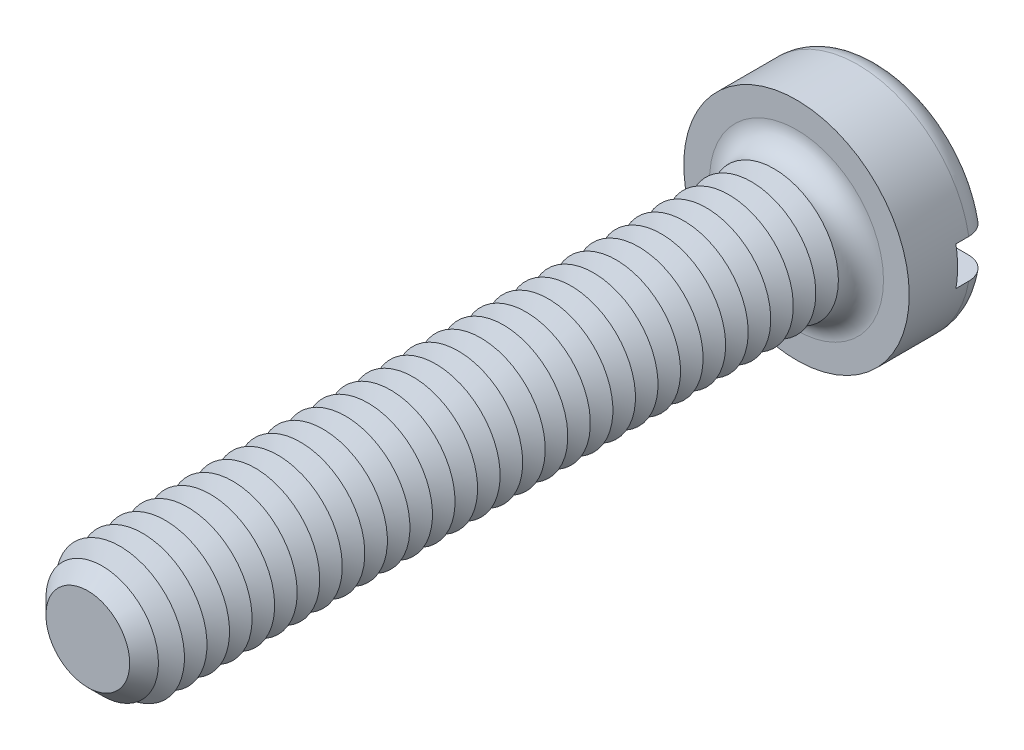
ISO-10303-21;
HEADER;
FILE_DESCRIPTION(('STEP AP214'),'2;1');
FILE_NAME('part.step','',(''),(''),'','','');
FILE_SCHEMA(('AUTOMOTIVE_DESIGN { 1 0 10303 214 1 1 1 1 }'));
ENDSEC;
DATA;
#1=APPLICATION_CONTEXT('core data for automotive mechanical design processes');
#2=APPLICATION_PROTOCOL_DEFINITION('international standard','automotive_design',2000,#1);
#3=PRODUCT_CONTEXT('',#1,'mechanical');
#4=PRODUCT('Part','Part','',(#3));
#5=PRODUCT_RELATED_PRODUCT_CATEGORY('part','',(#4));
#6=PRODUCT_DEFINITION_FORMATION('','',#4);
#7=PRODUCT_DEFINITION_CONTEXT('part definition',#1,'design');
#8=PRODUCT_DEFINITION('design','',#6,#7);
#9=PRODUCT_DEFINITION_SHAPE('','',#8);
#10=(LENGTH_UNIT() NAMED_UNIT(*) SI_UNIT(.MILLI.,.METRE.));
#11=(NAMED_UNIT(*) PLANE_ANGLE_UNIT() SI_UNIT($,.RADIAN.));
#12=(NAMED_UNIT(*) SI_UNIT($,.STERADIAN.) SOLID_ANGLE_UNIT());
#13=UNCERTAINTY_MEASURE_WITH_UNIT(LENGTH_MEASURE(1.E-05),#10,'distance_accuracy_value','');
#14=(GEOMETRIC_REPRESENTATION_CONTEXT(3) GLOBAL_UNCERTAINTY_ASSIGNED_CONTEXT((#13)) GLOBAL_UNIT_ASSIGNED_CONTEXT((#10,
#11,#12)) REPRESENTATION_CONTEXT('',''));
#15=CARTESIAN_POINT('',(0.,0.,0.));
#16=DIRECTION('',(0.,0.,1.));
#17=DIRECTION('',(1.,0.,0.));
#18=AXIS2_PLACEMENT_3D('',#15,#16,#17);
#19=CARTESIAN_POINT('',(0.,0.,-2.6));
#20=DIRECTION('',(0.,0.,1.));
#21=DIRECTION('',(1.,0.,0.));
#22=AXIS2_PLACEMENT_3D('',#19,#20,#21);
#23=PLANE('',#22);
#24=CARTESIAN_POINT('',(0.,0.,-2.6));
#25=DIRECTION('',(0.,0.,1.));
#26=DIRECTION('',(1.,0.,0.));
#27=AXIS2_PLACEMENT_3D('',#24,#25,#26);
#28=CIRCLE('',#27,2.8);
#29=CARTESIAN_POINT('',(-2.73495886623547,0.6,-2.6));
#30=VERTEX_POINT('',#29);
#31=CARTESIAN_POINT('',(2.73495886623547,0.6,-2.6));
#32=VERTEX_POINT('',#31);
#33=EDGE_CURVE('E116',#30,#32,#28,.F.);
#34=ORIENTED_EDGE('',*,*,#33,.T.);
#35=DIRECTION('',(1.,0.,0.));
#36=VECTOR('',#35,1.);
#37=CARTESIAN_POINT('',(-3.5,0.600000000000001,-2.6));
#38=LINE('',#37,#36);
#39=EDGE_CURVE('E111',#30,#32,#38,.T.);
#40=ORIENTED_EDGE('',*,*,#39,.F.);
#41=EDGE_LOOP('',(#34,#40));
#42=FACE_BOUND('',#41,.T.);
#43=ADVANCED_FACE('F39',(#42),#23,.F.);
#44=CARTESIAN_POINT('',(0.,0.,-1.9));
#45=DIRECTION('',(0.,0.,1.));
#46=DIRECTION('',(1.,0.,0.));
#47=AXIS2_PLACEMENT_3D('',#44,#45,#46);
#48=TOROIDAL_SURFACE('',#47,2.8,0.7);
#49=CARTESIAN_POINT('',(-3.24550494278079,0.600000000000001,-2.38938679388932));
#50=CARTESIAN_POINT('',(-3.21724139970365,0.600000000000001,-2.41780774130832));
#51=CARTESIAN_POINT('',(-3.18652103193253,0.600000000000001,-2.44383169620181));
#52=CARTESIAN_POINT('',(-3.12110229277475,0.600000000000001,-2.49034599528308));
#53=CARTESIAN_POINT('',(-3.08639834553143,0.6,-2.51082844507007));
#54=CARTESIAN_POINT('',(-3.01410013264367,0.6,-2.54568075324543));
#55=CARTESIAN_POINT('',(-2.97650963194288,0.6,-2.56005841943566));
#56=CARTESIAN_POINT('',(-2.89948250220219,0.6,-2.58239238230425));
#57=CARTESIAN_POINT('',(-2.86004633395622,0.6,-2.59035027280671));
#58=CARTESIAN_POINT('',(-2.77983715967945,0.6,-2.5997577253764));
#59=CARTESIAN_POINT('',(-2.73905311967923,0.6,-2.60111317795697));
#60=CARTESIAN_POINT('',(-2.65781876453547,0.6,-2.59706866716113));
#61=CARTESIAN_POINT('',(-2.61736849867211,0.6,-2.59166772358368));
#62=CARTESIAN_POINT('',(-2.53729983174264,0.6,-2.57414594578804));
#63=CARTESIAN_POINT('',(-2.49770360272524,0.6,-2.56192363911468));
#64=CARTESIAN_POINT('',(-2.421111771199,0.6,-2.5310238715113));
#65=CARTESIAN_POINT('',(-2.38411632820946,0.6,-2.51234601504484));
#66=CARTESIAN_POINT('',(-2.31371213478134,0.6,-2.46896762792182));
#67=CARTESIAN_POINT('',(-2.28031240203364,0.6,-2.44425244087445));
#68=CARTESIAN_POINT('',(-2.21823311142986,0.6,-2.38946667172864));
#69=CARTESIAN_POINT('',(-2.18955321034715,0.6,-2.35939647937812));
#70=CARTESIAN_POINT('',(-2.13836074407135,0.6,-2.29532787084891));
#71=CARTESIAN_POINT('',(-2.11574147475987,0.6,-2.26141482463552));
#72=CARTESIAN_POINT('',(-2.07677080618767,0.6,-2.19015935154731));
#73=CARTESIAN_POINT('',(-2.06041784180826,0.6,-2.15281778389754));
#74=CARTESIAN_POINT('',(-2.03508596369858,0.6,-2.07723332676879));
#75=CARTESIAN_POINT('',(-2.02585871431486,0.6,-2.03907365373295));
#76=CARTESIAN_POINT('',(-2.01416722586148,0.6,-1.96173417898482));
#77=CARTESIAN_POINT('',(-2.01170151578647,0.6,-1.92255460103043));
#78=CARTESIAN_POINT('',(-2.01359934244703,0.6,-1.84555709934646));
#79=CARTESIAN_POINT('',(-2.01775787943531,0.6,-1.80773393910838));
#80=CARTESIAN_POINT('',(-2.03236373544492,0.6,-1.73332511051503));
#81=CARTESIAN_POINT('',(-2.04281097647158,0.6,-1.69673942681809));
#82=CARTESIAN_POINT('',(-2.06962963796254,0.6,-1.62577336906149));
#83=CARTESIAN_POINT('',(-2.08600685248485,0.6,-1.59139519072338));
#84=CARTESIAN_POINT('',(-2.12413495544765,0.6,-1.52576356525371));
#85=CARTESIAN_POINT('',(-2.14588657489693,0.6,-1.49451054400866));
#86=CARTESIAN_POINT('',(-2.19483541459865,0.6,-1.43498643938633));
#87=CARTESIAN_POINT('',(-2.22217844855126,0.6,-1.40683532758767));
#88=CARTESIAN_POINT('',(-2.28105616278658,0.6,-1.35532544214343));
#89=CARTESIAN_POINT('',(-2.3125916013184,0.6,-1.33196753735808));
#90=CARTESIAN_POINT('',(-2.38018779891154,0.6,-1.28984356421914));
#91=CARTESIAN_POINT('',(-2.41637068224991,0.6,-1.27127330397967));
#92=CARTESIAN_POINT('',(-2.49129688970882,0.6,-1.24032971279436));
#93=CARTESIAN_POINT('',(-2.53004053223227,0.6,-1.22795715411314));
#94=CARTESIAN_POINT('',(-2.6098393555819,0.6,-1.2095515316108));
#95=CARTESIAN_POINT('',(-2.65092550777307,0.6,-1.20365237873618));
#96=CARTESIAN_POINT('',(-2.7335069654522,0.6,-1.1988380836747));
#97=CARTESIAN_POINT('',(-2.7750022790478,0.6,-1.19992308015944));
#98=CARTESIAN_POINT('',(-2.85718851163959,0.6,-1.20909046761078));
#99=CARTESIAN_POINT('',(-2.8978799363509,0.6,-1.21716830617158));
#100=CARTESIAN_POINT('',(-2.97729176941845,0.6,-1.24014327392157));
#101=CARTESIAN_POINT('',(-3.01601231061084,0.6,-1.25503994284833));
#102=CARTESIAN_POINT('',(-3.08976822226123,0.6,-1.29101066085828));
#103=CARTESIAN_POINT('',(-3.12484927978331,0.600000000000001,-1.31199098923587));
#104=CARTESIAN_POINT('',(-3.19090022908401,0.600000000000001,-1.35965144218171));
#105=CARTESIAN_POINT('',(-3.22187053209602,0.600000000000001,-1.38633099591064));
#106=CARTESIAN_POINT('',(-3.2781946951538,0.600000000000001,-1.44408564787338));
#107=CARTESIAN_POINT('',(-3.3036441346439,0.600000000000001,-1.47506754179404));
#108=CARTESIAN_POINT('',(-3.34887649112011,0.600000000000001,-1.54092398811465));
#109=CARTESIAN_POINT('',(-3.36865993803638,0.600000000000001,-1.57579817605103));
#110=CARTESIAN_POINT('',(-3.40166738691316,0.600000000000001,-1.64783067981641));
#111=CARTESIAN_POINT('',(-3.41499360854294,0.600000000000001,-1.68494217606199));
#112=CARTESIAN_POINT('',(-3.43515375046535,0.600000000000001,-1.76088675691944));
#113=CARTESIAN_POINT('',(-3.44198836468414,0.600000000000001,-1.79971965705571));
#114=CARTESIAN_POINT('',(-3.44891916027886,0.600000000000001,-1.87757893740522));
#115=CARTESIAN_POINT('',(-3.44908375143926,0.600000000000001,-1.91659924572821));
#116=CARTESIAN_POINT('',(-3.44284111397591,0.600000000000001,-1.99412088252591));
#117=CARTESIAN_POINT('',(-3.43643236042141,0.600000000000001,-2.03262208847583));
#118=CARTESIAN_POINT('',(-3.41725803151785,0.600000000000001,-2.10792315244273));
#119=CARTESIAN_POINT('',(-3.40450469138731,0.600000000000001,-2.14472613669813));
#120=CARTESIAN_POINT('',(-3.3730385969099,0.600000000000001,-2.21565060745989));
#121=CARTESIAN_POINT('',(-3.35433321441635,0.600000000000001,-2.24977534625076));
#122=CARTESIAN_POINT('',(-3.3201892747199,0.600000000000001,-2.30136364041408));
#123=CARTESIAN_POINT('',(-3.30647805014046,0.600000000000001,-2.31999402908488));
#124=CARTESIAN_POINT('',(-3.27728518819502,0.600000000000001,-2.35581090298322));
#125=CARTESIAN_POINT('',(-3.26180356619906,0.600000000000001,-2.37299740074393));
#126=CARTESIAN_POINT('',(-3.24550494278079,0.600000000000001,-2.38938679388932));
#127=B_SPLINE_CURVE_WITH_KNOTS('',3,(#49,#50,#51,#52,#53,#54,#55,#56,#57,#58,#59,#60,#61,#62,
#63,#64,#65,#66,#67,#68,#69,#70,#71,#72,#73,#74,#75,#76,#77,#78,#79,#80,#81,#82,#83,#84,#85,#86,
#87,#88,#89,#90,#91,#92,#93,#94,#95,#96,#97,#98,#99,#100,#101,#102,#103,#104,#105,#106,#107,
#108,#109,#110,#111,#112,#113,#114,#115,#116,#117,#118,#119,#120,#121,#122,#123,#124,#125,#126),
.UNSPECIFIED.,.T.,.F.,(4,2,2,2,2,2,2,2,2,2,2,2,2,2,2,2,2,2,2,2,2,2,2,2,2,2,2,2,2,2,2,2,2,2,2,2,
2,2,4),(0.,0.120160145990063,0.240490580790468,0.36066665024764,0.480812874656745,
0.602666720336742,0.724538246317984,0.848272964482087,0.972015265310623,1.09606100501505,
1.2200977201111,1.34178071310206,1.46343329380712,1.58062647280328,1.6977941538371,
1.81140573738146,1.92501591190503,2.03873739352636,2.15247435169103,2.26967910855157,
2.38690509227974,2.50835551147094,2.62982106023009,2.75375450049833,2.87769040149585,
3.00154567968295,3.12539259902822,3.24742469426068,3.36944457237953,3.48914477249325,
3.60883377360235,3.72656056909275,3.84427477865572,3.96078136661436,4.07731498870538,
4.19362474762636,4.3097910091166,4.37908387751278,4.44837614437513),.UNSPECIFIED.);
#128=CARTESIAN_POINT('',(-3.44818792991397,0.600000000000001,-1.8999999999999));
#129=VERTEX_POINT('',#128);
#130=EDGE_CURVE('E425',#129,#30,#127,.T.);
#131=ORIENTED_EDGE('',*,*,#130,.F.);
#132=CARTESIAN_POINT('',(0.,0.,-1.9));
#133=DIRECTION('',(0.,0.,1.));
#134=DIRECTION('',(1.,0.,0.));
#135=AXIS2_PLACEMENT_3D('',#132,#133,#134);
#136=CIRCLE('',#135,3.5);
#137=CARTESIAN_POINT('',(3.44818792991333,0.6,-1.9));
#138=VERTEX_POINT('',#137);
#139=EDGE_CURVE('E125',#138,#129,#136,.T.);
#140=ORIENTED_EDGE('',*,*,#139,.F.);
#141=CARTESIAN_POINT('',(2.1414268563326,0.6,-2.29762171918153));
#142=CARTESIAN_POINT('',(2.16505443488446,0.6,-2.33058245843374));
#143=CARTESIAN_POINT('',(2.19155609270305,0.6,-2.36152717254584));
#144=CARTESIAN_POINT('',(2.24942944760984,0.6,-2.41852964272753));
#145=CARTESIAN_POINT('',(2.28080921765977,0.6,-2.44457913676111));
#146=CARTESIAN_POINT('',(2.34741203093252,0.6,-2.49105381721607));
#147=CARTESIAN_POINT('',(2.38262862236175,0.6,-2.51148824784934));
#148=CARTESIAN_POINT('',(2.45593176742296,0.6,-2.54626881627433));
#149=CARTESIAN_POINT('',(2.49401741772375,0.6,-2.56061686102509));
#150=CARTESIAN_POINT('',(2.57272605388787,0.6,-2.58306429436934));
#151=CARTESIAN_POINT('',(2.6133821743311,0.6,-2.59104769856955));
#152=CARTESIAN_POINT('',(2.6954618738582,0.6,-2.60009608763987));
#153=CARTESIAN_POINT('',(2.73688552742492,0.6,-2.60116039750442));
#154=CARTESIAN_POINT('',(2.81941950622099,0.6,-2.5962925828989));
#155=CARTESIAN_POINT('',(2.86052888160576,0.6,-2.59034422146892));
#156=CARTESIAN_POINT('',(2.94113709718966,0.6,-2.57153687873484));
#157=CARTESIAN_POINT('',(2.98063603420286,0.6,-2.55867831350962));
#158=CARTESIAN_POINT('',(3.05633735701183,0.6,-2.52657771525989));
#159=CARTESIAN_POINT('',(3.09257627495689,0.6,-2.50742188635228));
#160=CARTESIAN_POINT('',(3.16123898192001,0.6,-2.46318606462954));
#161=CARTESIAN_POINT('',(3.19366316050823,0.6,-2.4381066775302));
#162=CARTESIAN_POINT('',(3.25312278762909,0.6,-2.38324481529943));
#163=CARTESIAN_POINT('',(3.28024842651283,0.6,-2.35356008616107));
#164=CARTESIAN_POINT('',(3.32902587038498,0.6,-2.28998971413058));
#165=CARTESIAN_POINT('',(3.35067820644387,0.6,-2.25610447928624));
#166=CARTESIAN_POINT('',(3.38751207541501,0.6,-2.18572286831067));
#167=CARTESIAN_POINT('',(3.40279804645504,0.6,-2.14928112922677));
#168=CARTESIAN_POINT('',(3.42695590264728,0.6,-2.07433042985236));
#169=CARTESIAN_POINT('',(3.43582824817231,0.6,-2.03582161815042));
#170=CARTESIAN_POINT('',(3.44682113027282,0.6,-1.95829536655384));
#171=CARTESIAN_POINT('',(3.44901648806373,0.6,-1.91928851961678));
#172=CARTESIAN_POINT('',(3.44680085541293,0.6,-1.84146366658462));
#173=CARTESIAN_POINT('',(3.44239008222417,0.6,-1.80264565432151));
#174=CARTESIAN_POINT('',(3.42712544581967,0.6,-1.72644634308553));
#175=CARTESIAN_POINT('',(3.41629508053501,0.6,-1.6890603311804));
#176=CARTESIAN_POINT('',(3.38853757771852,0.6,-1.61662604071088));
#177=CARTESIAN_POINT('',(3.37161039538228,0.6,-1.58157777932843));
#178=CARTESIAN_POINT('',(3.33207798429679,0.6,-1.51464178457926));
#179=CARTESIAN_POINT('',(3.30944854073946,0.6,-1.48276835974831));
#180=CARTESIAN_POINT('',(3.2592165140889,0.6,-1.42321861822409));
#181=CARTESIAN_POINT('',(3.23161370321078,0.6,-1.3955424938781));
#182=CARTESIAN_POINT('',(3.17188519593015,0.6,-1.34481834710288));
#183=CARTESIAN_POINT('',(3.13971065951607,0.6,-1.32182785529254));
#184=CARTESIAN_POINT('',(3.07201123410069,0.6,-1.28147003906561));
#185=CARTESIAN_POINT('',(3.03648608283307,0.6,-1.26410315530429));
#186=CARTESIAN_POINT('',(2.962449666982,0.6,-1.2351645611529));
#187=CARTESIAN_POINT('',(2.92389781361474,0.6,-1.22369671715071));
#188=CARTESIAN_POINT('',(2.84543273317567,0.6,-1.20726565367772));
#189=CARTESIAN_POINT('',(2.80551936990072,0.6,-1.20230308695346));
#190=CARTESIAN_POINT('',(2.72467191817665,0.6,-1.1989357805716));
#191=CARTESIAN_POINT('',(2.68373266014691,0.6,-1.20065484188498));
#192=CARTESIAN_POINT('',(2.60270222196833,0.6,-1.21084560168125));
#193=CARTESIAN_POINT('',(2.56261112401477,0.6,-1.21931795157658));
#194=CARTESIAN_POINT('',(2.48385954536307,0.6,-1.24292934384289));
#195=CARTESIAN_POINT('',(2.44522508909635,0.6,-1.25815531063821));
#196=CARTESIAN_POINT('',(2.37106165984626,0.6,-1.29488663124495));
#197=CARTESIAN_POINT('',(2.33553282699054,0.6,-1.31639226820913));
#198=CARTESIAN_POINT('',(2.2686996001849,0.6,-1.36507949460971));
#199=CARTESIAN_POINT('',(2.23738745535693,0.6,-1.39225042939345));
#200=CARTESIAN_POINT('',(2.17990424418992,0.6,-1.45157941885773));
#201=CARTESIAN_POINT('',(2.15373259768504,0.6,-1.48373691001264));
#202=CARTESIAN_POINT('',(2.10799355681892,0.6,-1.551327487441));
#203=CARTESIAN_POINT('',(2.08828258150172,0.6,-1.58666329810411));
#204=CARTESIAN_POINT('',(2.05534440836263,0.6,-1.66023600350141));
#205=CARTESIAN_POINT('',(2.042115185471,0.6,-1.6984719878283));
#206=CARTESIAN_POINT('',(2.02303126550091,0.6,-1.77519783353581));
#207=CARTESIAN_POINT('',(2.01691541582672,0.6,-1.8136228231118));
#208=CARTESIAN_POINT('',(2.01140375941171,0.6,-1.89096056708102));
#209=CARTESIAN_POINT('',(2.01200856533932,0.6,-1.92987336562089));
#210=CARTESIAN_POINT('',(2.01981617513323,0.6,-2.006065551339));
#211=CARTESIAN_POINT('',(2.02685835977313,0.6,-2.04336165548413));
#212=CARTESIAN_POINT('',(2.0470502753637,0.6,-2.1162250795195));
#213=CARTESIAN_POINT('',(2.06019252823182,0.6,-2.15179445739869));
#214=CARTESIAN_POINT('',(2.08525738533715,0.6,-2.20558874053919));
#215=CARTESIAN_POINT('',(2.09529161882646,0.6,-2.22471751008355));
#216=CARTESIAN_POINT('',(2.11708813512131,0.6,-2.26196179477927));
#217=CARTESIAN_POINT('',(2.12885034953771,0.6,-2.28007734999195));
#218=CARTESIAN_POINT('',(2.1414268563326,0.6,-2.29762171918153));
#219=B_SPLINE_CURVE_WITH_KNOTS('',3,(#141,#142,#143,#144,#145,#146,#147,#148,#149,#150,#151,
#152,#153,#154,#155,#156,#157,#158,#159,#160,#161,#162,#163,#164,#165,#166,#167,#168,#169,#170,
#171,#172,#173,#174,#175,#176,#177,#178,#179,#180,#181,#182,#183,#184,#185,#186,#187,#188,#189,
#190,#191,#192,#193,#194,#195,#196,#197,#198,#199,#200,#201,#202,#203,#204,#205,#206,#207,#208,
#209,#210,#211,#212,#213,#214,#215,#216,#217,#218),.UNSPECIFIED.,.T.,.F.,(4,2,2,2,2,2,2,2,2,2,2,
2,2,2,2,2,2,2,2,2,2,2,2,2,2,2,2,2,2,2,2,2,2,2,2,2,2,2,4),(0.,0.121582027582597,
0.243367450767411,0.364951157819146,0.486496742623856,0.610209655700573,0.733934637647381,
0.857946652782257,0.981951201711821,1.1043243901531,1.22668507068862,1.34673532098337,
1.46677391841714,1.58475736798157,1.70273234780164,1.81938035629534,1.93602452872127,
2.05224435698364,2.168465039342,2.28518782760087,2.40191596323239,2.52000081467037,
2.63809491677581,2.75820270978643,2.87832255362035,3.00067856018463,3.1230463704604,
3.24703703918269,3.37103329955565,3.49479843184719,3.6185495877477,3.73932715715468,
3.86006696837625,3.9762182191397,4.09238005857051,4.2057203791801,4.31892212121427,
4.38364046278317,4.44835624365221),.UNSPECIFIED.);
#220=EDGE_CURVE('E427',#32,#138,#219,.T.);
#221=ORIENTED_EDGE('',*,*,#220,.F.);
#222=ORIENTED_EDGE('',*,*,#33,.F.);
#223=EDGE_LOOP('',(#131,#140,#221,#222));
#224=FACE_BOUND('',#223,.T.);
#225=ADVANCED_FACE('F409',(#224),#48,.T.);
#226=CARTESIAN_POINT('',(0.,0.,-2.6));
#227=DIRECTION('',(0.,0.,1.));
#228=DIRECTION('',(1.,0.,0.));
#229=AXIS2_PLACEMENT_3D('',#226,#227,#228);
#230=CYLINDRICAL_SURFACE('',#229,3.5);
#231=DIRECTION('',(0.,0.,1.));
#232=VECTOR('',#231,1.);
#233=CARTESIAN_POINT('',(3.44818792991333,0.6,-2.6));
#234=LINE('',#233,#232);
#235=CARTESIAN_POINT('',(3.44818792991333,0.6,-1.5));
#236=VERTEX_POINT('',#235);
#237=EDGE_CURVE('E442',#138,#236,#234,.T.);
#238=ORIENTED_EDGE('',*,*,#237,.F.);
#239=ORIENTED_EDGE('',*,*,#139,.T.);
#240=DIRECTION('',(0.,0.,1.));
#241=VECTOR('',#240,1.);
#242=CARTESIAN_POINT('',(-3.44818792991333,0.600000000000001,-2.6));
#243=LINE('',#242,#241);
#244=CARTESIAN_POINT('',(-3.44818792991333,0.600000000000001,-1.5));
#245=VERTEX_POINT('',#244);
#246=EDGE_CURVE('E63',#245,#129,#243,.F.);
#247=ORIENTED_EDGE('',*,*,#246,.F.);
#248=CARTESIAN_POINT('',(0.,0.,-1.5));
#249=DIRECTION('',(0.,0.,-1.));
#250=DIRECTION('',(-1.,0.,0.));
#251=AXIS2_PLACEMENT_3D('',#248,#249,#250);
#252=CIRCLE('',#251,3.5);
#253=CARTESIAN_POINT('',(-3.44818792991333,-0.599999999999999,-1.5));
#254=VERTEX_POINT('',#253);
#255=EDGE_CURVE('E43',#245,#254,#252,.F.);
#256=ORIENTED_EDGE('',*,*,#255,.T.);
#257=DIRECTION('',(0.,0.,1.));
#258=VECTOR('',#257,1.);
#259=CARTESIAN_POINT('',(-3.44818792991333,-0.599999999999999,-2.6));
#260=LINE('',#259,#258);
#261=CARTESIAN_POINT('',(-3.44818792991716,-0.599999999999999,-1.90000000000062));
#262=VERTEX_POINT('',#261);
#263=EDGE_CURVE('E439',#262,#254,#260,.T.);
#264=ORIENTED_EDGE('',*,*,#263,.F.);
#265=CARTESIAN_POINT('',(3.44818792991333,-0.6,-1.9));
#266=VERTEX_POINT('',#265);
#267=EDGE_CURVE('E127',#262,#266,#136,.T.);
#268=ORIENTED_EDGE('',*,*,#267,.T.);
#269=DIRECTION('',(0.,0.,1.));
#270=VECTOR('',#269,1.);
#271=CARTESIAN_POINT('',(3.44818792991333,-0.6,-2.6));
#272=LINE('',#271,#270);
#273=CARTESIAN_POINT('',(3.44818792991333,-0.6,-1.5));
#274=VERTEX_POINT('',#273);
#275=EDGE_CURVE('E55',#274,#266,#272,.F.);
#276=ORIENTED_EDGE('',*,*,#275,.F.);
#277=EDGE_CURVE('E11',#274,#236,#252,.F.);
#278=ORIENTED_EDGE('',*,*,#277,.T.);
#279=EDGE_LOOP('',(#238,#239,#247,#256,#264,#268,#276,#278));
#280=FACE_BOUND('',#279,.T.);
#281=CARTESIAN_POINT('',(0.,0.,0.));
#282=DIRECTION('',(0.,0.,1.));
#283=DIRECTION('',(1.,0.,0.));
#284=AXIS2_PLACEMENT_3D('',#281,#282,#283);
#285=CIRCLE('',#284,3.5);
#286=CARTESIAN_POINT('',(3.5,0.,0.));
#287=VERTEX_POINT('',#286);
#288=EDGE_CURVE('E444',#287,#287,#285,.T.);
#289=ORIENTED_EDGE('',*,*,#288,.F.);
#290=EDGE_LOOP('',(#289));
#291=FACE_BOUND('',#290,.T.);
#292=ADVANCED_FACE('F405',(#280,#291),#230,.T.);
#293=CARTESIAN_POINT('',(2.73495886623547,-0.6,-2.6));
#294=VERTEX_POINT('',#293);
#295=CARTESIAN_POINT('',(-2.73495886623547,-0.6,-2.6));
#296=VERTEX_POINT('',#295);
#297=EDGE_CURVE('E109',#294,#296,#28,.F.);
#298=ORIENTED_EDGE('',*,*,#297,.T.);
#299=DIRECTION('',(-1.,0.,0.));
#300=VECTOR('',#299,1.);
#301=CARTESIAN_POINT('',(-3.5,-0.599999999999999,-2.6));
#302=LINE('',#301,#300);
#303=EDGE_CURVE('E96',#294,#296,#302,.T.);
#304=ORIENTED_EDGE('',*,*,#303,.F.);
#305=EDGE_LOOP('',(#298,#304));
#306=FACE_BOUND('',#305,.T.);
#307=ADVANCED_FACE('F108',(#306),#23,.F.);
#308=CARTESIAN_POINT('',(0.,0.,0.));
#309=DIRECTION('',(0.,0.,1.));
#310=DIRECTION('',(1.,0.,0.));
#311=AXIS2_PLACEMENT_3D('',#308,#309,#310);
#312=PLANE('',#311);
#313=CARTESIAN_POINT('',(0.,0.,0.));
#314=DIRECTION('',(0.,0.,1.));
#315=DIRECTION('',(1.,0.,0.));
#316=AXIS2_PLACEMENT_3D('',#313,#314,#315);
#317=CIRCLE('',#316,2.7);
#318=CARTESIAN_POINT('',(2.7,0.,0.));
#319=VERTEX_POINT('',#318);
#320=EDGE_CURVE('E115',#319,#319,#317,.F.);
#321=ORIENTED_EDGE('',*,*,#320,.T.);
#322=EDGE_LOOP('',(#321));
#323=FACE_BOUND('',#322,.T.);
#324=ORIENTED_EDGE('',*,*,#288,.T.);
#325=EDGE_LOOP('',(#324));
#326=FACE_BOUND('',#325,.T.);
#327=ADVANCED_FACE('F404',(#323,#326),#312,.T.);
#328=CARTESIAN_POINT('',(-3.24550494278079,-0.599999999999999,-2.38938679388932));
#329=CARTESIAN_POINT('',(-3.27309693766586,-0.599999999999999,-2.36163611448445));
#330=CARTESIAN_POINT('',(-3.29838741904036,-0.599999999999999,-2.3315608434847));
#331=CARTESIAN_POINT('',(-3.34359429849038,-0.599999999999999,-2.26757659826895));
#332=CARTESIAN_POINT('',(-3.36350518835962,-0.599999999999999,-2.23366374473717));
#333=CARTESIAN_POINT('',(-3.39733065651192,-0.599999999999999,-2.16296274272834));
#334=CARTESIAN_POINT('',(-3.4112451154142,-0.599999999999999,-2.12617453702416));
#335=CARTESIAN_POINT('',(-3.43264462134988,-0.599999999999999,-2.05078178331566));
#336=CARTESIAN_POINT('',(-3.44013114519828,-0.599999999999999,-2.01217765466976));
#337=CARTESIAN_POINT('',(-3.44841975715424,-0.599999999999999,-1.9345391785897));
#338=CARTESIAN_POINT('',(-3.44926944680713,-0.599999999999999,-1.89550990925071));
#339=CARTESIAN_POINT('',(-3.44438358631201,-0.599999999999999,-1.81786552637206));
#340=CARTESIAN_POINT('',(-3.43864801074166,-0.599999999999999,-1.77925041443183));
#341=CARTESIAN_POINT('',(-3.42079221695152,-0.599999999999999,-1.70364264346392));
#342=CARTESIAN_POINT('',(-3.40869011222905,-0.599999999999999,-1.66664570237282));
#343=CARTESIAN_POINT('',(-3.37847692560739,-0.599999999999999,-1.59519424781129));
#344=CARTESIAN_POINT('',(-3.3603657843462,-0.599999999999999,-1.56073975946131));
#345=CARTESIAN_POINT('',(-3.31856549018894,-0.599999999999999,-1.4951524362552));
#346=CARTESIAN_POINT('',(-3.29484830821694,-0.599999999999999,-1.46403747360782));
#347=CARTESIAN_POINT('',(-3.24258489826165,-0.599999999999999,-1.40617131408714));
#348=CARTESIAN_POINT('',(-3.21403843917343,-0.599999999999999,-1.37942032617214));
#349=CARTESIAN_POINT('',(-3.15256084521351,-0.599999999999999,-1.33067963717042));
#350=CARTESIAN_POINT('',(-3.11958015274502,-0.599999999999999,-1.30875246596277));
#351=CARTESIAN_POINT('',(-3.0504559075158,-0.599999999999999,-1.27063718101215));
#352=CARTESIAN_POINT('',(-3.01431209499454,-0.6,-1.25444953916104));
#353=CARTESIAN_POINT('',(-2.93921710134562,-0.6,-1.22796796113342));
#354=CARTESIAN_POINT('',(-2.90022796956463,-0.6,-1.217781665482));
#355=CARTESIAN_POINT('',(-2.82110512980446,-0.6,-1.20396915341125));
#356=CARTESIAN_POINT('',(-2.7809713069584,-0.6,-1.2003435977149));
#357=CARTESIAN_POINT('',(-2.69990924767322,-0.6,-1.19969717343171));
#358=CARTESIAN_POINT('',(-2.65898001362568,-0.6,-1.20279937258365));
#359=CARTESIAN_POINT('',(-2.57819986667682,-0.6,-1.21574287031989));
#360=CARTESIAN_POINT('',(-2.53834905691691,-0.6,-1.22558481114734));
#361=CARTESIAN_POINT('',(-2.46035232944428,-0.6,-1.25189361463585));
#362=CARTESIAN_POINT('',(-2.42223314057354,-0.6,-1.2684398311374));
#363=CARTESIAN_POINT('',(-2.34932316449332,-0.6,-1.30771928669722));
#364=CARTESIAN_POINT('',(-2.31453248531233,-0.6,-1.33045272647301));
#365=CARTESIAN_POINT('',(-2.24945577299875,-0.6,-1.38141543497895));
#366=CARTESIAN_POINT('',(-2.21915255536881,-0.6,-1.40962272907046));
#367=CARTESIAN_POINT('',(-2.16386461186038,-0.6,-1.47084552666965));
#368=CARTESIAN_POINT('',(-2.13887916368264,-0.6,-1.50386037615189));
#369=CARTESIAN_POINT('',(-2.09568071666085,-0.6,-1.57285917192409));
#370=CARTESIAN_POINT('',(-2.07730739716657,-0.6,-1.60874263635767));
#371=CARTESIAN_POINT('',(-2.04712019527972,-0.6,-1.68316975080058));
#372=CARTESIAN_POINT('',(-2.03530452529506,-0.6,-1.72171267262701));
#373=CARTESIAN_POINT('',(-2.01901751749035,-0.6,-1.79878952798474));
#374=CARTESIAN_POINT('',(-2.01428434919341,-0.6,-1.8372682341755));
#375=CARTESIAN_POINT('',(-2.01150652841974,-0.6,-1.91446369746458));
#376=CARTESIAN_POINT('',(-2.01346084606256,-0.6,-1.95318041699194));
#377=CARTESIAN_POINT('',(-2.02386268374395,-0.6,-2.0288619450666));
#378=CARTESIAN_POINT('',(-2.03216724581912,-0.6,-2.06584654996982));
#379=CARTESIAN_POINT('',(-2.05479337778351,-0.6,-2.13792373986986));
#380=CARTESIAN_POINT('',(-2.06911522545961,-0.6,-2.1730162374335));
#381=CARTESIAN_POINT('',(-2.10349906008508,-0.6,-2.24081034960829));
#382=CARTESIAN_POINT('',(-2.12363007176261,-0.6,-2.27347689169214));
#383=CARTESIAN_POINT('',(-2.16891308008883,-0.6,-2.33511902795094));
#384=CARTESIAN_POINT('',(-2.19406590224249,-0.6,-2.36409401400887));
#385=CARTESIAN_POINT('',(-2.24962389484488,-0.6,-2.41861972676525));
#386=CARTESIAN_POINT('',(-2.28018314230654,-0.6,-2.44401345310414));
#387=CARTESIAN_POINT('',(-2.34501720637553,-0.6,-2.48950558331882));
#388=CARTESIAN_POINT('',(-2.37929266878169,-0.6,-2.50960306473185));
#389=CARTESIAN_POINT('',(-2.45179417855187,-0.6,-2.54458276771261));
#390=CARTESIAN_POINT('',(-2.49011248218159,-0.6,-2.55927401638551));
#391=CARTESIAN_POINT('',(-2.56865227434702,-0.6,-2.58211133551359));
#392=CARTESIAN_POINT('',(-2.60887386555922,-0.6,-2.59025705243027));
#393=CARTESIAN_POINT('',(-2.69064746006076,-0.6,-2.59982905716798));
#394=CARTESIAN_POINT('',(-2.73220999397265,-0.6,-2.60116580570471));
#395=CARTESIAN_POINT('',(-2.81497658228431,-0.6,-2.59679700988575));
#396=CARTESIAN_POINT('',(-2.85618055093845,-0.6,-2.59108982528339));
#397=CARTESIAN_POINT('',(-2.93677683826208,-0.6,-2.57279487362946));
#398=CARTESIAN_POINT('',(-2.97617834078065,-0.6,-2.56024753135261));
#399=CARTESIAN_POINT('',(-3.05222242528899,-0.6,-2.52860709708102));
#400=CARTESIAN_POINT('',(-3.08886850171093,-0.599999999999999,-2.50952247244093));
#401=CARTESIAN_POINT('',(-3.14562501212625,-0.599999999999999,-2.47340693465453));
#402=CARTESIAN_POINT('',(-3.16689358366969,-0.599999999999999,-2.45816337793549));
#403=CARTESIAN_POINT('',(-3.20761866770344,-0.599999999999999,-2.42542115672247));
#404=CARTESIAN_POINT('',(-3.22707520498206,-0.599999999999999,-2.40792252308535));
#405=CARTESIAN_POINT('',(-3.24550494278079,-0.599999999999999,-2.38938679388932));
#406=B_SPLINE_CURVE_WITH_KNOTS('',3,(#328,#329,#330,#331,#332,#333,#334,#335,#336,#337,#338,
#339,#340,#341,#342,#343,#344,#345,#346,#347,#348,#349,#350,#351,#352,#353,#354,#355,#356,#357,
#358,#359,#360,#361,#362,#363,#364,#365,#366,#367,#368,#369,#370,#371,#372,#373,#374,#375,#376,
#377,#378,#379,#380,#381,#382,#383,#384,#385,#386,#387,#388,#389,#390,#391,#392,#393,#394,#395,
#396,#397,#398,#399,#400,#401,#402,#403,#404,#405),.UNSPECIFIED.,.T.,.F.,(4,2,2,2,2,2,2,2,2,2,2,
2,2,2,2,2,2,2,2,2,2,2,2,2,2,2,2,2,2,2,2,2,2,2,2,2,2,2,4),(0.,0.117306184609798,
0.234732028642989,0.352160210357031,0.469561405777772,0.586119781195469,0.702678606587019,
0.818907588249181,0.935137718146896,1.05196174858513,1.1687913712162,1.2870562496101,
1.40533084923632,1.52566688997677,1.64601504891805,1.76858322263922,1.89116307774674,
2.01523830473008,2.13931755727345,2.26290863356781,2.38648291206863,2.50681878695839,
2.62712184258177,2.74285697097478,2.85857427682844,2.97176054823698,3.08495204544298,
3.19954814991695,3.31416310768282,3.43282436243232,3.55150627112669,3.67404987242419,
3.79660009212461,3.92075778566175,4.04494439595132,4.16840490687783,4.29170610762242,
4.3700604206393,4.44841366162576),.UNSPECIFIED.);
#407=EDGE_CURVE('E103',#296,#262,#406,.T.);
#408=ORIENTED_EDGE('',*,*,#407,.F.);
#409=ORIENTED_EDGE('',*,*,#297,.F.);
#410=CARTESIAN_POINT('',(2.1414268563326,-0.6,-2.29762171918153));
#411=CARTESIAN_POINT('',(2.11900044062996,-0.6,-2.26633119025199));
#412=CARTESIAN_POINT('',(2.09913154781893,-0.6,-2.23318080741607));
#413=CARTESIAN_POINT('',(2.06517900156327,-0.6,-2.16401111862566));
#414=CARTESIAN_POINT('',(2.05109968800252,-0.6,-2.12798968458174));
#415=CARTESIAN_POINT('',(2.02923593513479,-0.6,-2.05404277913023));
#416=CARTESIAN_POINT('',(2.02145692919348,-0.6,-2.01611569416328));
#417=CARTESIAN_POINT('',(2.01251710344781,-0.6,-1.93949649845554));
#418=CARTESIAN_POINT('',(2.01135461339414,-0.6,-1.90080458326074));
#419=CARTESIAN_POINT('',(2.01564803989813,-0.6,-1.82450508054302));
#420=CARTESIAN_POINT('',(2.02098305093,-0.6,-1.78689061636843));
#421=CARTESIAN_POINT('',(2.03786826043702,-0.6,-1.71308589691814));
#422=CARTESIAN_POINT('',(2.04941870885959,-0.6,-1.67689569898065));
#423=CARTESIAN_POINT('',(2.07838664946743,-0.6,-1.60676639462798));
#424=CARTESIAN_POINT('',(2.09582944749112,-0.6,-1.57283776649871));
#425=CARTESIAN_POINT('',(2.1359925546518,-0.6,-1.50826612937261));
#426=CARTESIAN_POINT('',(2.15871360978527,-0.6,-1.47762358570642));
#427=CARTESIAN_POINT('',(2.20955413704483,-0.6,-1.41943384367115));
#428=CARTESIAN_POINT('',(2.23782364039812,-0.6,-1.39201777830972));
#429=CARTESIAN_POINT('',(2.29842612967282,-0.6,-1.34212199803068));
#430=CARTESIAN_POINT('',(2.33075984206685,-0.6,-1.31964316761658));
#431=CARTESIAN_POINT('',(2.399806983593,-0.6,-1.27945238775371));
#432=CARTESIAN_POINT('',(2.43663466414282,-0.6,-1.26193653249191));
#433=CARTESIAN_POINT('',(2.51267241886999,-0.6,-1.23320660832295));
#434=CARTESIAN_POINT('',(2.55188277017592,-0.6,-1.22199327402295));
#435=CARTESIAN_POINT('',(2.63235000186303,-0.6,-1.20602688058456));
#436=CARTESIAN_POINT('',(2.673631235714,-0.6,-1.20139617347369));
#437=CARTESIAN_POINT('',(2.7563863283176,-0.6,-1.19914622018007));
#438=CARTESIAN_POINT('',(2.79786018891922,-0.6,-1.20152704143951));
#439=CARTESIAN_POINT('',(2.87971192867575,-0.6,-1.21326884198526));
#440=CARTESIAN_POINT('',(2.92009214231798,-0.6,-1.22261349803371));
#441=CARTESIAN_POINT('',(2.99866777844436,-0.6,-1.24805614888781));
#442=CARTESIAN_POINT('',(3.03686335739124,-0.6,-1.26415365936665));
#443=CARTESIAN_POINT('',(3.10934738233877,-0.6,-1.3023912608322));
#444=CARTESIAN_POINT('',(3.14368704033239,-0.6,-1.32443423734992));
#445=CARTESIAN_POINT('',(3.20808395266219,-0.6,-1.37407725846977));
#446=CARTESIAN_POINT('',(3.23814164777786,-0.6,-1.40167673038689));
#447=CARTESIAN_POINT('',(3.29251534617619,-0.6,-1.46108303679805));
#448=CARTESIAN_POINT('',(3.3169296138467,-0.6,-1.49279994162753));
#449=CARTESIAN_POINT('',(3.35998418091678,-0.6,-1.55993706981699));
#450=CARTESIAN_POINT('',(3.37862502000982,-0.6,-1.59535694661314));
#451=CARTESIAN_POINT('',(3.40930212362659,-0.6,-1.668283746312));
#452=CARTESIAN_POINT('',(3.42143897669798,-0.6,-1.70574837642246));
#453=CARTESIAN_POINT('',(3.43918305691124,-0.6,-1.78219297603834));
#454=CARTESIAN_POINT('',(3.44479069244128,-0.6,-1.82117285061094));
#455=CARTESIAN_POINT('',(3.44928173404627,-0.6,-1.89914596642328));
#456=CARTESIAN_POINT('',(3.44822835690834,-0.6,-1.93813558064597));
#457=CARTESIAN_POINT('',(3.43957811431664,-0.6,-2.0153811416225));
#458=CARTESIAN_POINT('',(3.43198139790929,-0.6,-2.05363710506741));
#459=CARTESIAN_POINT('',(3.41049386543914,-0.6,-2.12826741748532));
#460=CARTESIAN_POINT('',(3.39661362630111,-0.6,-2.16464481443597));
#461=CARTESIAN_POINT('',(3.36297924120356,-0.6,-2.23457274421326));
#462=CARTESIAN_POINT('',(3.34322499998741,-0.6,-2.26812323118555));
#463=CARTESIAN_POINT('',(3.29828706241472,-0.6,-2.33167864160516));
#464=CARTESIAN_POINT('',(3.27307040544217,-0.6,-2.36166024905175));
#465=CARTESIAN_POINT('',(3.21802069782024,-0.6,-2.41703165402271));
#466=CARTESIAN_POINT('',(3.18818738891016,-0.6,-2.44242119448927));
#467=CARTESIAN_POINT('',(3.12433871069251,-0.6,-2.48825551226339));
#468=CARTESIAN_POINT('',(3.09027338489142,-0.6,-2.50863067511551));
#469=CARTESIAN_POINT('',(3.01925175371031,-0.6,-2.54348754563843));
#470=CARTESIAN_POINT('',(2.982295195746,-0.6,-2.55796873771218));
#471=CARTESIAN_POINT('',(2.90583499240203,-0.6,-2.58090526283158));
#472=CARTESIAN_POINT('',(2.86629758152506,-0.6,-2.58924801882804));
#473=CARTESIAN_POINT('',(2.78639041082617,-0.6,-2.59930573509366));
#474=CARTESIAN_POINT('',(2.7460205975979,-0.6,-2.60102026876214));
#475=CARTESIAN_POINT('',(2.66482039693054,-0.6,-2.59779078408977));
#476=CARTESIAN_POINT('',(2.62399477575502,-0.6,-2.59272651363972));
#477=CARTESIAN_POINT('',(2.54373809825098,-0.6,-2.57588976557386));
#478=CARTESIAN_POINT('',(2.50430750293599,-0.6,-2.56411509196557));
#479=CARTESIAN_POINT('',(2.42753167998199,-0.6,-2.53401488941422));
#480=CARTESIAN_POINT('',(2.39021407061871,-0.6,-2.51561892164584));
#481=CARTESIAN_POINT('',(2.31925431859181,-0.6,-2.4727929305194));
#482=CARTESIAN_POINT('',(2.28560806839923,-0.6,-2.44836975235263));
#483=CARTESIAN_POINT('',(2.23316677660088,-0.6,-2.40295212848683));
#484=CARTESIAN_POINT('',(2.21309339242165,-0.6,-2.38341311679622));
#485=CARTESIAN_POINT('',(2.17537212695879,-0.6,-2.34211733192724));
#486=CARTESIAN_POINT('',(2.1577241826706,-0.6,-2.32036061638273));
#487=CARTESIAN_POINT('',(2.1414268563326,-0.6,-2.29762171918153));
#488=B_SPLINE_CURVE_WITH_KNOTS('',3,(#410,#411,#412,#413,#414,#415,#416,#417,#418,#419,#420,
#421,#422,#423,#424,#425,#426,#427,#428,#429,#430,#431,#432,#433,#434,#435,#436,#437,#438,#439,
#440,#441,#442,#443,#444,#445,#446,#447,#448,#449,#450,#451,#452,#453,#454,#455,#456,#457,#458,
#459,#460,#461,#462,#463,#464,#465,#466,#467,#468,#469,#470,#471,#472,#473,#474,#475,#476,#477,
#478,#479,#480,#481,#482,#483,#484,#485,#486,#487),.UNSPECIFIED.,.T.,.F.,(4,2,2,2,2,2,2,2,2,2,2,
2,2,2,2,2,2,2,2,2,2,2,2,2,2,2,2,2,2,2,2,2,2,2,2,2,2,2,4),(0.,0.115394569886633,
0.230875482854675,0.346455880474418,0.462007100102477,0.575440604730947,0.688878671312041,
0.802810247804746,0.91675793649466,1.03436780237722,1.15199872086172,1.27377854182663,
1.39557255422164,1.51960202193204,1.64363268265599,1.76737352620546,1.89110549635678,
2.01292743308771,2.13473682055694,2.25423121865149,2.37371444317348,2.49129215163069,
2.60886250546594,2.72531873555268,2.8417723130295,2.95803059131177,3.07429075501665,
3.19127301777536,3.30826182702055,3.42679321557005,3.54533497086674,3.66599996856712,
3.78667273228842,3.90951478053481,4.03239705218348,4.15662720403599,4.28071691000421,
4.36457658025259,4.44843407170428),.UNSPECIFIED.);
#489=EDGE_CURVE('E92',#266,#294,#488,.T.);
#490=ORIENTED_EDGE('',*,*,#489,.F.);
#491=ORIENTED_EDGE('',*,*,#267,.F.);
#492=EDGE_LOOP('',(#408,#409,#490,#491));
#493=FACE_BOUND('',#492,.T.);
#494=ADVANCED_FACE('F113',(#493),#48,.T.);
#495=CARTESIAN_POINT('',(0.,0.,0.699999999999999));
#496=DIRECTION('',(0.,0.,1.));
#497=DIRECTION('',(1.,0.,0.));
#498=AXIS2_PLACEMENT_3D('',#495,#496,#497);
#499=TOROIDAL_SURFACE('',#498,2.7,0.7);
#500=ORIENTED_EDGE('',*,*,#320,.F.);
#501=EDGE_LOOP('',(#500));
#502=FACE_BOUND('',#501,.T.);
#503=CARTESIAN_POINT('',(0.,0.,0.699999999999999));
#504=DIRECTION('',(0.,0.,-1.));
#505=DIRECTION('',(-1.,0.,0.));
#506=AXIS2_PLACEMENT_3D('',#503,#504,#505);
#507=CIRCLE('',#506,2.);
#508=CARTESIAN_POINT('',(-2.,0.,0.699999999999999));
#509=VERTEX_POINT('',#508);
#510=EDGE_CURVE('E449',#509,#509,#507,.T.);
#511=ORIENTED_EDGE('',*,*,#510,.T.);
#512=EDGE_LOOP('',(#511));
#513=FACE_BOUND('',#512,.T.);
#514=ADVANCED_FACE('F397',(#502,#513),#499,.F.);
#515=CARTESIAN_POINT('',(0.,0.,1.05));
#516=DIRECTION('',(0.,0.,-1.));
#517=DIRECTION('',(-1.,0.,0.));
#518=AXIS2_PLACEMENT_3D('',#515,#516,#517);
#519=CONICAL_SURFACE('',#518,1.39378221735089,1.0471975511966);
#520=ORIENTED_EDGE('',*,*,#510,.F.);
#521=EDGE_LOOP('',(#520));
#522=FACE_BOUND('',#521,.T.);
#523=CARTESIAN_POINT('',(0.,0.,1.05));
#524=DIRECTION('',(0.,0.,-1.));
#525=DIRECTION('',(-1.,0.,0.));
#526=AXIS2_PLACEMENT_3D('',#523,#524,#525);
#527=CIRCLE('',#526,1.39378221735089);
#528=CARTESIAN_POINT('',(-1.39378221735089,0.,1.05));
#529=VERTEX_POINT('',#528);
#530=EDGE_CURVE('E455',#529,#529,#527,.T.);
#531=ORIENTED_EDGE('',*,*,#530,.T.);
#532=EDGE_LOOP('',(#531));
#533=FACE_BOUND('',#532,.T.);
#534=ADVANCED_FACE('F393',(#522,#533),#519,.T.);
#535=CARTESIAN_POINT('',(0.,0.,1.4));
#536=DIRECTION('',(0.,0.,1.));
#537=DIRECTION('',(1.,0.,0.));
#538=AXIS2_PLACEMENT_3D('',#535,#536,#537);
#539=CONICAL_SURFACE('',#538,2.,1.0471975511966);
#540=ORIENTED_EDGE('',*,*,#530,.F.);
#541=EDGE_LOOP('',(#540));
#542=FACE_BOUND('',#541,.T.);
#543=CARTESIAN_POINT('',(0.,0.,1.4));
#544=DIRECTION('',(0.,0.,-1.));
#545=DIRECTION('',(-1.,0.,0.));
#546=AXIS2_PLACEMENT_3D('',#543,#544,#545);
#547=CIRCLE('',#546,2.);
#548=CARTESIAN_POINT('',(-2.,0.,1.4));
#549=VERTEX_POINT('',#548);
#550=EDGE_CURVE('E461',#549,#549,#547,.T.);
#551=ORIENTED_EDGE('',*,*,#550,.T.);
#552=EDGE_LOOP('',(#551));
#553=FACE_BOUND('',#552,.T.);
#554=ADVANCED_FACE('F389',(#542,#553),#539,.T.);
#555=CARTESIAN_POINT('',(0.,0.,1.75));
#556=DIRECTION('',(0.,0.,-1.));
#557=DIRECTION('',(-1.,0.,0.));
#558=AXIS2_PLACEMENT_3D('',#555,#556,#557);
#559=CONICAL_SURFACE('',#558,1.39378221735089,1.0471975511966);
#560=ORIENTED_EDGE('',*,*,#550,.F.);
#561=EDGE_LOOP('',(#560));
#562=FACE_BOUND('',#561,.T.);
#563=CARTESIAN_POINT('',(0.,0.,1.75));
#564=DIRECTION('',(0.,0.,-1.));
#565=DIRECTION('',(-1.,0.,0.));
#566=AXIS2_PLACEMENT_3D('',#563,#564,#565);
#567=CIRCLE('',#566,1.39378221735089);
#568=CARTESIAN_POINT('',(-1.39378221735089,0.,1.75));
#569=VERTEX_POINT('',#568);
#570=EDGE_CURVE('E465',#569,#569,#567,.T.);
#571=ORIENTED_EDGE('',*,*,#570,.T.);
#572=EDGE_LOOP('',(#571));
#573=FACE_BOUND('',#572,.T.);
#574=ADVANCED_FACE('F385',(#562,#573),#559,.T.);
#575=CARTESIAN_POINT('',(0.,0.,2.1));
#576=DIRECTION('',(0.,0.,1.));
#577=DIRECTION('',(1.,0.,0.));
#578=AXIS2_PLACEMENT_3D('',#575,#576,#577);
#579=CONICAL_SURFACE('',#578,2.,1.0471975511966);
#580=ORIENTED_EDGE('',*,*,#570,.F.);
#581=EDGE_LOOP('',(#580));
#582=FACE_BOUND('',#581,.T.);
#583=CARTESIAN_POINT('',(0.,0.,2.1));
#584=DIRECTION('',(0.,0.,-1.));
#585=DIRECTION('',(-1.,0.,0.));
#586=AXIS2_PLACEMENT_3D('',#583,#584,#585);
#587=CIRCLE('',#586,2.);
#588=CARTESIAN_POINT('',(-2.,0.,2.1));
#589=VERTEX_POINT('',#588);
#590=EDGE_CURVE('E469',#589,#589,#587,.T.);
#591=ORIENTED_EDGE('',*,*,#590,.T.);
#592=EDGE_LOOP('',(#591));
#593=FACE_BOUND('',#592,.T.);
#594=ADVANCED_FACE('F381',(#582,#593),#579,.T.);
#595=CARTESIAN_POINT('',(0.,0.,2.45));
#596=DIRECTION('',(0.,0.,-1.));
#597=DIRECTION('',(-1.,0.,0.));
#598=AXIS2_PLACEMENT_3D('',#595,#596,#597);
#599=CONICAL_SURFACE('',#598,1.39378221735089,1.0471975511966);
#600=ORIENTED_EDGE('',*,*,#590,.F.);
#601=EDGE_LOOP('',(#600));
#602=FACE_BOUND('',#601,.T.);
#603=CARTESIAN_POINT('',(0.,0.,2.45));
#604=DIRECTION('',(0.,0.,-1.));
#605=DIRECTION('',(-1.,0.,0.));
#606=AXIS2_PLACEMENT_3D('',#603,#604,#605);
#607=CIRCLE('',#606,1.39378221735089);
#608=CARTESIAN_POINT('',(-1.39378221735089,0.,2.45));
#609=VERTEX_POINT('',#608);
#610=EDGE_CURVE('E473',#609,#609,#607,.T.);
#611=ORIENTED_EDGE('',*,*,#610,.T.);
#612=EDGE_LOOP('',(#611));
#613=FACE_BOUND('',#612,.T.);
#614=ADVANCED_FACE('F377',(#602,#613),#599,.T.);
#615=CARTESIAN_POINT('',(0.,0.,2.8));
#616=DIRECTION('',(0.,0.,1.));
#617=DIRECTION('',(1.,0.,0.));
#618=AXIS2_PLACEMENT_3D('',#615,#616,#617);
#619=CONICAL_SURFACE('',#618,2.,1.0471975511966);
#620=ORIENTED_EDGE('',*,*,#610,.F.);
#621=EDGE_LOOP('',(#620));
#622=FACE_BOUND('',#621,.T.);
#623=CARTESIAN_POINT('',(0.,0.,2.8));
#624=DIRECTION('',(0.,0.,-1.));
#625=DIRECTION('',(-1.,0.,0.));
#626=AXIS2_PLACEMENT_3D('',#623,#624,#625);
#627=CIRCLE('',#626,2.);
#628=CARTESIAN_POINT('',(-2.,0.,2.8));
#629=VERTEX_POINT('',#628);
#630=EDGE_CURVE('E477',#629,#629,#627,.T.);
#631=ORIENTED_EDGE('',*,*,#630,.T.);
#632=EDGE_LOOP('',(#631));
#633=FACE_BOUND('',#632,.T.);
#634=ADVANCED_FACE('F373',(#622,#633),#619,.T.);
#635=CARTESIAN_POINT('',(0.,0.,3.15));
#636=DIRECTION('',(0.,0.,-1.));
#637=DIRECTION('',(-1.,0.,0.));
#638=AXIS2_PLACEMENT_3D('',#635,#636,#637);
#639=CONICAL_SURFACE('',#638,1.39378221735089,1.0471975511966);
#640=ORIENTED_EDGE('',*,*,#630,.F.);
#641=EDGE_LOOP('',(#640));
#642=FACE_BOUND('',#641,.T.);
#643=CARTESIAN_POINT('',(0.,0.,3.15));
#644=DIRECTION('',(0.,0.,-1.));
#645=DIRECTION('',(-1.,0.,0.));
#646=AXIS2_PLACEMENT_3D('',#643,#644,#645);
#647=CIRCLE('',#646,1.39378221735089);
#648=CARTESIAN_POINT('',(-1.39378221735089,0.,3.15));
#649=VERTEX_POINT('',#648);
#650=EDGE_CURVE('E481',#649,#649,#647,.T.);
#651=ORIENTED_EDGE('',*,*,#650,.T.);
#652=EDGE_LOOP('',(#651));
#653=FACE_BOUND('',#652,.T.);
#654=ADVANCED_FACE('F369',(#642,#653),#639,.T.);
#655=CARTESIAN_POINT('',(0.,0.,3.5));
#656=DIRECTION('',(0.,0.,1.));
#657=DIRECTION('',(1.,0.,0.));
#658=AXIS2_PLACEMENT_3D('',#655,#656,#657);
#659=CONICAL_SURFACE('',#658,2.,1.0471975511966);
#660=ORIENTED_EDGE('',*,*,#650,.F.);
#661=EDGE_LOOP('',(#660));
#662=FACE_BOUND('',#661,.T.);
#663=CARTESIAN_POINT('',(0.,0.,3.5));
#664=DIRECTION('',(0.,0.,-1.));
#665=DIRECTION('',(-1.,0.,0.));
#666=AXIS2_PLACEMENT_3D('',#663,#664,#665);
#667=CIRCLE('',#666,2.);
#668=CARTESIAN_POINT('',(-2.,0.,3.5));
#669=VERTEX_POINT('',#668);
#670=EDGE_CURVE('E485',#669,#669,#667,.T.);
#671=ORIENTED_EDGE('',*,*,#670,.T.);
#672=EDGE_LOOP('',(#671));
#673=FACE_BOUND('',#672,.T.);
#674=ADVANCED_FACE('F365',(#662,#673),#659,.T.);
#675=CARTESIAN_POINT('',(0.,0.,3.85));
#676=DIRECTION('',(0.,0.,-1.));
#677=DIRECTION('',(-1.,0.,0.));
#678=AXIS2_PLACEMENT_3D('',#675,#676,#677);
#679=CONICAL_SURFACE('',#678,1.39378221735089,1.0471975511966);
#680=ORIENTED_EDGE('',*,*,#670,.F.);
#681=EDGE_LOOP('',(#680));
#682=FACE_BOUND('',#681,.T.);
#683=CARTESIAN_POINT('',(0.,0.,3.85));
#684=DIRECTION('',(0.,0.,-1.));
#685=DIRECTION('',(-1.,0.,0.));
#686=AXIS2_PLACEMENT_3D('',#683,#684,#685);
#687=CIRCLE('',#686,1.39378221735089);
#688=CARTESIAN_POINT('',(-1.39378221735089,0.,3.85));
#689=VERTEX_POINT('',#688);
#690=EDGE_CURVE('E489',#689,#689,#687,.T.);
#691=ORIENTED_EDGE('',*,*,#690,.T.);
#692=EDGE_LOOP('',(#691));
#693=FACE_BOUND('',#692,.T.);
#694=ADVANCED_FACE('F361',(#682,#693),#679,.T.);
#695=CARTESIAN_POINT('',(0.,0.,4.2));
#696=DIRECTION('',(0.,0.,1.));
#697=DIRECTION('',(1.,0.,0.));
#698=AXIS2_PLACEMENT_3D('',#695,#696,#697);
#699=CONICAL_SURFACE('',#698,2.,1.0471975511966);
#700=ORIENTED_EDGE('',*,*,#690,.F.);
#701=EDGE_LOOP('',(#700));
#702=FACE_BOUND('',#701,.T.);
#703=CARTESIAN_POINT('',(0.,0.,4.2));
#704=DIRECTION('',(0.,0.,-1.));
#705=DIRECTION('',(-1.,0.,0.));
#706=AXIS2_PLACEMENT_3D('',#703,#704,#705);
#707=CIRCLE('',#706,2.);
#708=CARTESIAN_POINT('',(-2.,0.,4.2));
#709=VERTEX_POINT('',#708);
#710=EDGE_CURVE('E493',#709,#709,#707,.T.);
#711=ORIENTED_EDGE('',*,*,#710,.T.);
#712=EDGE_LOOP('',(#711));
#713=FACE_BOUND('',#712,.T.);
#714=ADVANCED_FACE('F357',(#702,#713),#699,.T.);
#715=CARTESIAN_POINT('',(0.,0.,4.55));
#716=DIRECTION('',(0.,0.,-1.));
#717=DIRECTION('',(-1.,0.,0.));
#718=AXIS2_PLACEMENT_3D('',#715,#716,#717);
#719=CONICAL_SURFACE('',#718,1.39378221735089,1.0471975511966);
#720=ORIENTED_EDGE('',*,*,#710,.F.);
#721=EDGE_LOOP('',(#720));
#722=FACE_BOUND('',#721,.T.);
#723=CARTESIAN_POINT('',(0.,0.,4.55));
#724=DIRECTION('',(0.,0.,-1.));
#725=DIRECTION('',(-1.,0.,0.));
#726=AXIS2_PLACEMENT_3D('',#723,#724,#725);
#727=CIRCLE('',#726,1.39378221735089);
#728=CARTESIAN_POINT('',(-1.39378221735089,0.,4.55));
#729=VERTEX_POINT('',#728);
#730=EDGE_CURVE('E497',#729,#729,#727,.T.);
#731=ORIENTED_EDGE('',*,*,#730,.T.);
#732=EDGE_LOOP('',(#731));
#733=FACE_BOUND('',#732,.T.);
#734=ADVANCED_FACE('F353',(#722,#733),#719,.T.);
#735=CARTESIAN_POINT('',(0.,0.,4.9));
#736=DIRECTION('',(0.,0.,1.));
#737=DIRECTION('',(1.,0.,0.));
#738=AXIS2_PLACEMENT_3D('',#735,#736,#737);
#739=CONICAL_SURFACE('',#738,2.,1.0471975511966);
#740=ORIENTED_EDGE('',*,*,#730,.F.);
#741=EDGE_LOOP('',(#740));
#742=FACE_BOUND('',#741,.T.);
#743=CARTESIAN_POINT('',(0.,0.,4.9));
#744=DIRECTION('',(0.,0.,-1.));
#745=DIRECTION('',(-1.,0.,0.));
#746=AXIS2_PLACEMENT_3D('',#743,#744,#745);
#747=CIRCLE('',#746,2.);
#748=CARTESIAN_POINT('',(-2.,0.,4.9));
#749=VERTEX_POINT('',#748);
#750=EDGE_CURVE('E501',#749,#749,#747,.T.);
#751=ORIENTED_EDGE('',*,*,#750,.T.);
#752=EDGE_LOOP('',(#751));
#753=FACE_BOUND('',#752,.T.);
#754=ADVANCED_FACE('F349',(#742,#753),#739,.T.);
#755=CARTESIAN_POINT('',(0.,0.,5.25));
#756=DIRECTION('',(0.,0.,-1.));
#757=DIRECTION('',(-1.,0.,0.));
#758=AXIS2_PLACEMENT_3D('',#755,#756,#757);
#759=CONICAL_SURFACE('',#758,1.39378221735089,1.0471975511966);
#760=ORIENTED_EDGE('',*,*,#750,.F.);
#761=EDGE_LOOP('',(#760));
#762=FACE_BOUND('',#761,.T.);
#763=CARTESIAN_POINT('',(0.,0.,5.25));
#764=DIRECTION('',(0.,0.,-1.));
#765=DIRECTION('',(-1.,0.,0.));
#766=AXIS2_PLACEMENT_3D('',#763,#764,#765);
#767=CIRCLE('',#766,1.39378221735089);
#768=CARTESIAN_POINT('',(-1.39378221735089,0.,5.25));
#769=VERTEX_POINT('',#768);
#770=EDGE_CURVE('E505',#769,#769,#767,.T.);
#771=ORIENTED_EDGE('',*,*,#770,.T.);
#772=EDGE_LOOP('',(#771));
#773=FACE_BOUND('',#772,.T.);
#774=ADVANCED_FACE('F345',(#762,#773),#759,.T.);
#775=CARTESIAN_POINT('',(0.,0.,5.6));
#776=DIRECTION('',(0.,0.,1.));
#777=DIRECTION('',(1.,0.,0.));
#778=AXIS2_PLACEMENT_3D('',#775,#776,#777);
#779=CONICAL_SURFACE('',#778,2.,1.0471975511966);
#780=ORIENTED_EDGE('',*,*,#770,.F.);
#781=EDGE_LOOP('',(#780));
#782=FACE_BOUND('',#781,.T.);
#783=CARTESIAN_POINT('',(0.,0.,5.6));
#784=DIRECTION('',(0.,0.,-1.));
#785=DIRECTION('',(-1.,0.,0.));
#786=AXIS2_PLACEMENT_3D('',#783,#784,#785);
#787=CIRCLE('',#786,2.);
#788=CARTESIAN_POINT('',(-2.,0.,5.6));
#789=VERTEX_POINT('',#788);
#790=EDGE_CURVE('E509',#789,#789,#787,.T.);
#791=ORIENTED_EDGE('',*,*,#790,.T.);
#792=EDGE_LOOP('',(#791));
#793=FACE_BOUND('',#792,.T.);
#794=ADVANCED_FACE('F341',(#782,#793),#779,.T.);
#795=CARTESIAN_POINT('',(0.,0.,5.95));
#796=DIRECTION('',(0.,0.,-1.));
#797=DIRECTION('',(-1.,0.,0.));
#798=AXIS2_PLACEMENT_3D('',#795,#796,#797);
#799=CONICAL_SURFACE('',#798,1.39378221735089,1.0471975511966);
#800=ORIENTED_EDGE('',*,*,#790,.F.);
#801=EDGE_LOOP('',(#800));
#802=FACE_BOUND('',#801,.T.);
#803=CARTESIAN_POINT('',(0.,0.,5.95));
#804=DIRECTION('',(0.,0.,-1.));
#805=DIRECTION('',(-1.,0.,0.));
#806=AXIS2_PLACEMENT_3D('',#803,#804,#805);
#807=CIRCLE('',#806,1.39378221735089);
#808=CARTESIAN_POINT('',(-1.39378221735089,0.,5.95));
#809=VERTEX_POINT('',#808);
#810=EDGE_CURVE('E513',#809,#809,#807,.T.);
#811=ORIENTED_EDGE('',*,*,#810,.T.);
#812=EDGE_LOOP('',(#811));
#813=FACE_BOUND('',#812,.T.);
#814=ADVANCED_FACE('F337',(#802,#813),#799,.T.);
#815=CARTESIAN_POINT('',(0.,0.,6.3));
#816=DIRECTION('',(0.,0.,1.));
#817=DIRECTION('',(1.,0.,0.));
#818=AXIS2_PLACEMENT_3D('',#815,#816,#817);
#819=CONICAL_SURFACE('',#818,2.,1.0471975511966);
#820=ORIENTED_EDGE('',*,*,#810,.F.);
#821=EDGE_LOOP('',(#820));
#822=FACE_BOUND('',#821,.T.);
#823=CARTESIAN_POINT('',(0.,0.,6.3));
#824=DIRECTION('',(0.,0.,-1.));
#825=DIRECTION('',(-1.,0.,0.));
#826=AXIS2_PLACEMENT_3D('',#823,#824,#825);
#827=CIRCLE('',#826,2.);
#828=CARTESIAN_POINT('',(-2.,0.,6.3));
#829=VERTEX_POINT('',#828);
#830=EDGE_CURVE('E517',#829,#829,#827,.T.);
#831=ORIENTED_EDGE('',*,*,#830,.T.);
#832=EDGE_LOOP('',(#831));
#833=FACE_BOUND('',#832,.T.);
#834=ADVANCED_FACE('F333',(#822,#833),#819,.T.);
#835=CARTESIAN_POINT('',(0.,0.,6.65));
#836=DIRECTION('',(0.,0.,-1.));
#837=DIRECTION('',(-1.,0.,0.));
#838=AXIS2_PLACEMENT_3D('',#835,#836,#837);
#839=CONICAL_SURFACE('',#838,1.39378221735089,1.0471975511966);
#840=ORIENTED_EDGE('',*,*,#830,.F.);
#841=EDGE_LOOP('',(#840));
#842=FACE_BOUND('',#841,.T.);
#843=CARTESIAN_POINT('',(0.,0.,6.65));
#844=DIRECTION('',(0.,0.,-1.));
#845=DIRECTION('',(-1.,0.,0.));
#846=AXIS2_PLACEMENT_3D('',#843,#844,#845);
#847=CIRCLE('',#846,1.39378221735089);
#848=CARTESIAN_POINT('',(-1.39378221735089,0.,6.65));
#849=VERTEX_POINT('',#848);
#850=EDGE_CURVE('E521',#849,#849,#847,.T.);
#851=ORIENTED_EDGE('',*,*,#850,.T.);
#852=EDGE_LOOP('',(#851));
#853=FACE_BOUND('',#852,.T.);
#854=ADVANCED_FACE('F329',(#842,#853),#839,.T.);
#855=CARTESIAN_POINT('',(0.,0.,7.));
#856=DIRECTION('',(0.,0.,1.));
#857=DIRECTION('',(1.,0.,0.));
#858=AXIS2_PLACEMENT_3D('',#855,#856,#857);
#859=CONICAL_SURFACE('',#858,2.,1.0471975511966);
#860=ORIENTED_EDGE('',*,*,#850,.F.);
#861=EDGE_LOOP('',(#860));
#862=FACE_BOUND('',#861,.T.);
#863=CARTESIAN_POINT('',(0.,0.,7.));
#864=DIRECTION('',(0.,0.,-1.));
#865=DIRECTION('',(-1.,0.,0.));
#866=AXIS2_PLACEMENT_3D('',#863,#864,#865);
#867=CIRCLE('',#866,2.);
#868=CARTESIAN_POINT('',(-2.,0.,7.));
#869=VERTEX_POINT('',#868);
#870=EDGE_CURVE('E525',#869,#869,#867,.T.);
#871=ORIENTED_EDGE('',*,*,#870,.T.);
#872=EDGE_LOOP('',(#871));
#873=FACE_BOUND('',#872,.T.);
#874=ADVANCED_FACE('F325',(#862,#873),#859,.T.);
#875=CARTESIAN_POINT('',(0.,0.,7.35));
#876=DIRECTION('',(0.,0.,-1.));
#877=DIRECTION('',(-1.,0.,0.));
#878=AXIS2_PLACEMENT_3D('',#875,#876,#877);
#879=CONICAL_SURFACE('',#878,1.39378221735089,1.0471975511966);
#880=ORIENTED_EDGE('',*,*,#870,.F.);
#881=EDGE_LOOP('',(#880));
#882=FACE_BOUND('',#881,.T.);
#883=CARTESIAN_POINT('',(0.,0.,7.35));
#884=DIRECTION('',(0.,0.,-1.));
#885=DIRECTION('',(-1.,0.,0.));
#886=AXIS2_PLACEMENT_3D('',#883,#884,#885);
#887=CIRCLE('',#886,1.39378221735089);
#888=CARTESIAN_POINT('',(-1.39378221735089,0.,7.35));
#889=VERTEX_POINT('',#888);
#890=EDGE_CURVE('E529',#889,#889,#887,.T.);
#891=ORIENTED_EDGE('',*,*,#890,.T.);
#892=EDGE_LOOP('',(#891));
#893=FACE_BOUND('',#892,.T.);
#894=ADVANCED_FACE('F321',(#882,#893),#879,.T.);
#895=CARTESIAN_POINT('',(0.,0.,7.7));
#896=DIRECTION('',(0.,0.,1.));
#897=DIRECTION('',(1.,0.,0.));
#898=AXIS2_PLACEMENT_3D('',#895,#896,#897);
#899=CONICAL_SURFACE('',#898,2.,1.0471975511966);
#900=ORIENTED_EDGE('',*,*,#890,.F.);
#901=EDGE_LOOP('',(#900));
#902=FACE_BOUND('',#901,.T.);
#903=CARTESIAN_POINT('',(0.,0.,7.7));
#904=DIRECTION('',(0.,0.,-1.));
#905=DIRECTION('',(-1.,0.,0.));
#906=AXIS2_PLACEMENT_3D('',#903,#904,#905);
#907=CIRCLE('',#906,2.);
#908=CARTESIAN_POINT('',(-2.,0.,7.7));
#909=VERTEX_POINT('',#908);
#910=EDGE_CURVE('E533',#909,#909,#907,.T.);
#911=ORIENTED_EDGE('',*,*,#910,.T.);
#912=EDGE_LOOP('',(#911));
#913=FACE_BOUND('',#912,.T.);
#914=ADVANCED_FACE('F317',(#902,#913),#899,.T.);
#915=CARTESIAN_POINT('',(0.,0.,8.05));
#916=DIRECTION('',(0.,0.,-1.));
#917=DIRECTION('',(-1.,0.,0.));
#918=AXIS2_PLACEMENT_3D('',#915,#916,#917);
#919=CONICAL_SURFACE('',#918,1.39378221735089,1.0471975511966);
#920=ORIENTED_EDGE('',*,*,#910,.F.);
#921=EDGE_LOOP('',(#920));
#922=FACE_BOUND('',#921,.T.);
#923=CARTESIAN_POINT('',(0.,0.,8.05));
#924=DIRECTION('',(0.,0.,-1.));
#925=DIRECTION('',(-1.,0.,0.));
#926=AXIS2_PLACEMENT_3D('',#923,#924,#925);
#927=CIRCLE('',#926,1.39378221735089);
#928=CARTESIAN_POINT('',(-1.39378221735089,0.,8.05));
#929=VERTEX_POINT('',#928);
#930=EDGE_CURVE('E536',#929,#929,#927,.T.);
#931=ORIENTED_EDGE('',*,*,#930,.T.);
#932=EDGE_LOOP('',(#931));
#933=FACE_BOUND('',#932,.T.);
#934=ADVANCED_FACE('F313',(#922,#933),#919,.T.);
#935=CARTESIAN_POINT('',(0.,0.,8.4));
#936=DIRECTION('',(0.,0.,1.));
#937=DIRECTION('',(1.,0.,0.));
#938=AXIS2_PLACEMENT_3D('',#935,#936,#937);
#939=CONICAL_SURFACE('',#938,2.,1.0471975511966);
#940=ORIENTED_EDGE('',*,*,#930,.F.);
#941=EDGE_LOOP('',(#940));
#942=FACE_BOUND('',#941,.T.);
#943=CARTESIAN_POINT('',(0.,0.,8.4));
#944=DIRECTION('',(0.,0.,-1.));
#945=DIRECTION('',(-1.,0.,0.));
#946=AXIS2_PLACEMENT_3D('',#943,#944,#945);
#947=CIRCLE('',#946,2.);
#948=CARTESIAN_POINT('',(-2.,0.,8.4));
#949=VERTEX_POINT('',#948);
#950=EDGE_CURVE('E539',#949,#949,#947,.T.);
#951=ORIENTED_EDGE('',*,*,#950,.T.);
#952=EDGE_LOOP('',(#951));
#953=FACE_BOUND('',#952,.T.);
#954=ADVANCED_FACE('F309',(#942,#953),#939,.T.);
#955=CARTESIAN_POINT('',(0.,0.,8.75));
#956=DIRECTION('',(0.,0.,-1.));
#957=DIRECTION('',(-1.,0.,0.));
#958=AXIS2_PLACEMENT_3D('',#955,#956,#957);
#959=CONICAL_SURFACE('',#958,1.39378221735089,1.0471975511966);
#960=ORIENTED_EDGE('',*,*,#950,.F.);
#961=EDGE_LOOP('',(#960));
#962=FACE_BOUND('',#961,.T.);
#963=CARTESIAN_POINT('',(0.,0.,8.75));
#964=DIRECTION('',(0.,0.,-1.));
#965=DIRECTION('',(-1.,0.,0.));
#966=AXIS2_PLACEMENT_3D('',#963,#964,#965);
#967=CIRCLE('',#966,1.39378221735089);
#968=CARTESIAN_POINT('',(-1.39378221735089,0.,8.75));
#969=VERTEX_POINT('',#968);
#970=EDGE_CURVE('E543',#969,#969,#967,.T.);
#971=ORIENTED_EDGE('',*,*,#970,.T.);
#972=EDGE_LOOP('',(#971));
#973=FACE_BOUND('',#972,.T.);
#974=ADVANCED_FACE('F305',(#962,#973),#959,.T.);
#975=CARTESIAN_POINT('',(0.,0.,9.1));
#976=DIRECTION('',(0.,0.,1.));
#977=DIRECTION('',(1.,0.,0.));
#978=AXIS2_PLACEMENT_3D('',#975,#976,#977);
#979=CONICAL_SURFACE('',#978,2.,1.0471975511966);
#980=ORIENTED_EDGE('',*,*,#970,.F.);
#981=EDGE_LOOP('',(#980));
#982=FACE_BOUND('',#981,.T.);
#983=CARTESIAN_POINT('',(0.,0.,9.1));
#984=DIRECTION('',(0.,0.,-1.));
#985=DIRECTION('',(-1.,0.,0.));
#986=AXIS2_PLACEMENT_3D('',#983,#984,#985);
#987=CIRCLE('',#986,2.);
#988=CARTESIAN_POINT('',(-2.,0.,9.1));
#989=VERTEX_POINT('',#988);
#990=EDGE_CURVE('E547',#989,#989,#987,.T.);
#991=ORIENTED_EDGE('',*,*,#990,.T.);
#992=EDGE_LOOP('',(#991));
#993=FACE_BOUND('',#992,.T.);
#994=ADVANCED_FACE('F301',(#982,#993),#979,.T.);
#995=CARTESIAN_POINT('',(0.,0.,9.45));
#996=DIRECTION('',(0.,0.,-1.));
#997=DIRECTION('',(-1.,0.,0.));
#998=AXIS2_PLACEMENT_3D('',#995,#996,#997);
#999=CONICAL_SURFACE('',#998,1.39378221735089,1.0471975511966);
#1000=ORIENTED_EDGE('',*,*,#990,.F.);
#1001=EDGE_LOOP('',(#1000));
#1002=FACE_BOUND('',#1001,.T.);
#1003=CARTESIAN_POINT('',(0.,0.,9.45));
#1004=DIRECTION('',(0.,0.,-1.));
#1005=DIRECTION('',(-1.,0.,0.));
#1006=AXIS2_PLACEMENT_3D('',#1003,#1004,#1005);
#1007=CIRCLE('',#1006,1.39378221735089);
#1008=CARTESIAN_POINT('',(-1.39378221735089,0.,9.45));
#1009=VERTEX_POINT('',#1008);
#1010=EDGE_CURVE('E551',#1009,#1009,#1007,.T.);
#1011=ORIENTED_EDGE('',*,*,#1010,.T.);
#1012=EDGE_LOOP('',(#1011));
#1013=FACE_BOUND('',#1012,.T.);
#1014=ADVANCED_FACE('F297',(#1002,#1013),#999,.T.);
#1015=CARTESIAN_POINT('',(0.,0.,9.8));
#1016=DIRECTION('',(0.,0.,1.));
#1017=DIRECTION('',(1.,0.,0.));
#1018=AXIS2_PLACEMENT_3D('',#1015,#1016,#1017);
#1019=CONICAL_SURFACE('',#1018,2.,1.0471975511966);
#1020=ORIENTED_EDGE('',*,*,#1010,.F.);
#1021=EDGE_LOOP('',(#1020));
#1022=FACE_BOUND('',#1021,.T.);
#1023=CARTESIAN_POINT('',(0.,0.,9.8));
#1024=DIRECTION('',(0.,0.,-1.));
#1025=DIRECTION('',(-1.,0.,0.));
#1026=AXIS2_PLACEMENT_3D('',#1023,#1024,#1025);
#1027=CIRCLE('',#1026,2.);
#1028=CARTESIAN_POINT('',(-2.,0.,9.8));
#1029=VERTEX_POINT('',#1028);
#1030=EDGE_CURVE('E555',#1029,#1029,#1027,.T.);
#1031=ORIENTED_EDGE('',*,*,#1030,.T.);
#1032=EDGE_LOOP('',(#1031));
#1033=FACE_BOUND('',#1032,.T.);
#1034=ADVANCED_FACE('F293',(#1022,#1033),#1019,.T.);
#1035=CARTESIAN_POINT('',(0.,0.,10.15));
#1036=DIRECTION('',(0.,0.,-1.));
#1037=DIRECTION('',(-1.,0.,0.));
#1038=AXIS2_PLACEMENT_3D('',#1035,#1036,#1037);
#1039=CONICAL_SURFACE('',#1038,1.39378221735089,1.0471975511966);
#1040=ORIENTED_EDGE('',*,*,#1030,.F.);
#1041=EDGE_LOOP('',(#1040));
#1042=FACE_BOUND('',#1041,.T.);
#1043=CARTESIAN_POINT('',(0.,0.,10.15));
#1044=DIRECTION('',(0.,0.,-1.));
#1045=DIRECTION('',(-1.,0.,0.));
#1046=AXIS2_PLACEMENT_3D('',#1043,#1044,#1045);
#1047=CIRCLE('',#1046,1.39378221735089);
#1048=CARTESIAN_POINT('',(-1.39378221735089,0.,10.15));
#1049=VERTEX_POINT('',#1048);
#1050=EDGE_CURVE('E559',#1049,#1049,#1047,.T.);
#1051=ORIENTED_EDGE('',*,*,#1050,.T.);
#1052=EDGE_LOOP('',(#1051));
#1053=FACE_BOUND('',#1052,.T.);
#1054=ADVANCED_FACE('F289',(#1042,#1053),#1039,.T.);
#1055=CARTESIAN_POINT('',(0.,0.,10.5));
#1056=DIRECTION('',(0.,0.,1.));
#1057=DIRECTION('',(1.,0.,0.));
#1058=AXIS2_PLACEMENT_3D('',#1055,#1056,#1057);
#1059=CONICAL_SURFACE('',#1058,2.,1.0471975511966);
#1060=ORIENTED_EDGE('',*,*,#1050,.F.);
#1061=EDGE_LOOP('',(#1060));
#1062=FACE_BOUND('',#1061,.T.);
#1063=CARTESIAN_POINT('',(0.,0.,10.5));
#1064=DIRECTION('',(0.,0.,-1.));
#1065=DIRECTION('',(-1.,0.,0.));
#1066=AXIS2_PLACEMENT_3D('',#1063,#1064,#1065);
#1067=CIRCLE('',#1066,2.);
#1068=CARTESIAN_POINT('',(-2.,0.,10.5));
#1069=VERTEX_POINT('',#1068);
#1070=EDGE_CURVE('E563',#1069,#1069,#1067,.T.);
#1071=ORIENTED_EDGE('',*,*,#1070,.T.);
#1072=EDGE_LOOP('',(#1071));
#1073=FACE_BOUND('',#1072,.T.);
#1074=ADVANCED_FACE('F285',(#1062,#1073),#1059,.T.);
#1075=CARTESIAN_POINT('',(0.,0.,10.85));
#1076=DIRECTION('',(0.,0.,-1.));
#1077=DIRECTION('',(-1.,0.,0.));
#1078=AXIS2_PLACEMENT_3D('',#1075,#1076,#1077);
#1079=CONICAL_SURFACE('',#1078,1.39378221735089,1.0471975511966);
#1080=ORIENTED_EDGE('',*,*,#1070,.F.);
#1081=EDGE_LOOP('',(#1080));
#1082=FACE_BOUND('',#1081,.T.);
#1083=CARTESIAN_POINT('',(0.,0.,10.85));
#1084=DIRECTION('',(0.,0.,-1.));
#1085=DIRECTION('',(-1.,0.,0.));
#1086=AXIS2_PLACEMENT_3D('',#1083,#1084,#1085);
#1087=CIRCLE('',#1086,1.39378221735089);
#1088=CARTESIAN_POINT('',(-1.39378221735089,0.,10.85));
#1089=VERTEX_POINT('',#1088);
#1090=EDGE_CURVE('E567',#1089,#1089,#1087,.T.);
#1091=ORIENTED_EDGE('',*,*,#1090,.T.);
#1092=EDGE_LOOP('',(#1091));
#1093=FACE_BOUND('',#1092,.T.);
#1094=ADVANCED_FACE('F281',(#1082,#1093),#1079,.T.);
#1095=CARTESIAN_POINT('',(0.,0.,11.2));
#1096=DIRECTION('',(0.,0.,1.));
#1097=DIRECTION('',(1.,0.,0.));
#1098=AXIS2_PLACEMENT_3D('',#1095,#1096,#1097);
#1099=CONICAL_SURFACE('',#1098,2.,1.0471975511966);
#1100=ORIENTED_EDGE('',*,*,#1090,.F.);
#1101=EDGE_LOOP('',(#1100));
#1102=FACE_BOUND('',#1101,.T.);
#1103=CARTESIAN_POINT('',(0.,0.,11.2));
#1104=DIRECTION('',(0.,0.,-1.));
#1105=DIRECTION('',(-1.,0.,0.));
#1106=AXIS2_PLACEMENT_3D('',#1103,#1104,#1105);
#1107=CIRCLE('',#1106,2.);
#1108=CARTESIAN_POINT('',(-2.,0.,11.2));
#1109=VERTEX_POINT('',#1108);
#1110=EDGE_CURVE('E571',#1109,#1109,#1107,.T.);
#1111=ORIENTED_EDGE('',*,*,#1110,.T.);
#1112=EDGE_LOOP('',(#1111));
#1113=FACE_BOUND('',#1112,.T.);
#1114=ADVANCED_FACE('F277',(#1102,#1113),#1099,.T.);
#1115=CARTESIAN_POINT('',(0.,0.,11.55));
#1116=DIRECTION('',(0.,0.,-1.));
#1117=DIRECTION('',(-1.,0.,0.));
#1118=AXIS2_PLACEMENT_3D('',#1115,#1116,#1117);
#1119=CONICAL_SURFACE('',#1118,1.39378221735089,1.0471975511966);
#1120=ORIENTED_EDGE('',*,*,#1110,.F.);
#1121=EDGE_LOOP('',(#1120));
#1122=FACE_BOUND('',#1121,.T.);
#1123=CARTESIAN_POINT('',(0.,0.,11.55));
#1124=DIRECTION('',(0.,0.,-1.));
#1125=DIRECTION('',(-1.,0.,0.));
#1126=AXIS2_PLACEMENT_3D('',#1123,#1124,#1125);
#1127=CIRCLE('',#1126,1.39378221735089);
#1128=CARTESIAN_POINT('',(-1.39378221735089,0.,11.55));
#1129=VERTEX_POINT('',#1128);
#1130=EDGE_CURVE('E575',#1129,#1129,#1127,.T.);
#1131=ORIENTED_EDGE('',*,*,#1130,.T.);
#1132=EDGE_LOOP('',(#1131));
#1133=FACE_BOUND('',#1132,.T.);
#1134=ADVANCED_FACE('F273',(#1122,#1133),#1119,.T.);
#1135=CARTESIAN_POINT('',(0.,0.,11.9));
#1136=DIRECTION('',(0.,0.,1.));
#1137=DIRECTION('',(1.,0.,0.));
#1138=AXIS2_PLACEMENT_3D('',#1135,#1136,#1137);
#1139=CONICAL_SURFACE('',#1138,2.,1.0471975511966);
#1140=ORIENTED_EDGE('',*,*,#1130,.F.);
#1141=EDGE_LOOP('',(#1140));
#1142=FACE_BOUND('',#1141,.T.);
#1143=CARTESIAN_POINT('',(0.,0.,11.9));
#1144=DIRECTION('',(0.,0.,-1.));
#1145=DIRECTION('',(-1.,0.,0.));
#1146=AXIS2_PLACEMENT_3D('',#1143,#1144,#1145);
#1147=CIRCLE('',#1146,2.);
#1148=CARTESIAN_POINT('',(-2.,0.,11.9));
#1149=VERTEX_POINT('',#1148);
#1150=EDGE_CURVE('E579',#1149,#1149,#1147,.T.);
#1151=ORIENTED_EDGE('',*,*,#1150,.T.);
#1152=EDGE_LOOP('',(#1151));
#1153=FACE_BOUND('',#1152,.T.);
#1154=ADVANCED_FACE('F269',(#1142,#1153),#1139,.T.);
#1155=CARTESIAN_POINT('',(0.,0.,12.25));
#1156=DIRECTION('',(0.,0.,-1.));
#1157=DIRECTION('',(-1.,0.,0.));
#1158=AXIS2_PLACEMENT_3D('',#1155,#1156,#1157);
#1159=CONICAL_SURFACE('',#1158,1.39378221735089,1.0471975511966);
#1160=ORIENTED_EDGE('',*,*,#1150,.F.);
#1161=EDGE_LOOP('',(#1160));
#1162=FACE_BOUND('',#1161,.T.);
#1163=CARTESIAN_POINT('',(0.,0.,12.25));
#1164=DIRECTION('',(0.,0.,-1.));
#1165=DIRECTION('',(-1.,0.,0.));
#1166=AXIS2_PLACEMENT_3D('',#1163,#1164,#1165);
#1167=CIRCLE('',#1166,1.39378221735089);
#1168=CARTESIAN_POINT('',(-1.39378221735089,0.,12.25));
#1169=VERTEX_POINT('',#1168);
#1170=EDGE_CURVE('E583',#1169,#1169,#1167,.T.);
#1171=ORIENTED_EDGE('',*,*,#1170,.T.);
#1172=EDGE_LOOP('',(#1171));
#1173=FACE_BOUND('',#1172,.T.);
#1174=ADVANCED_FACE('F265',(#1162,#1173),#1159,.T.);
#1175=CARTESIAN_POINT('',(0.,0.,12.6));
#1176=DIRECTION('',(0.,0.,1.));
#1177=DIRECTION('',(1.,0.,0.));
#1178=AXIS2_PLACEMENT_3D('',#1175,#1176,#1177);
#1179=CONICAL_SURFACE('',#1178,2.,1.0471975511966);
#1180=ORIENTED_EDGE('',*,*,#1170,.F.);
#1181=EDGE_LOOP('',(#1180));
#1182=FACE_BOUND('',#1181,.T.);
#1183=CARTESIAN_POINT('',(0.,0.,12.6));
#1184=DIRECTION('',(0.,0.,-1.));
#1185=DIRECTION('',(-1.,0.,0.));
#1186=AXIS2_PLACEMENT_3D('',#1183,#1184,#1185);
#1187=CIRCLE('',#1186,2.);
#1188=CARTESIAN_POINT('',(-2.,0.,12.6));
#1189=VERTEX_POINT('',#1188);
#1190=EDGE_CURVE('E587',#1189,#1189,#1187,.T.);
#1191=ORIENTED_EDGE('',*,*,#1190,.T.);
#1192=EDGE_LOOP('',(#1191));
#1193=FACE_BOUND('',#1192,.T.);
#1194=ADVANCED_FACE('F261',(#1182,#1193),#1179,.T.);
#1195=CARTESIAN_POINT('',(0.,0.,12.95));
#1196=DIRECTION('',(0.,0.,-1.));
#1197=DIRECTION('',(-1.,0.,0.));
#1198=AXIS2_PLACEMENT_3D('',#1195,#1196,#1197);
#1199=CONICAL_SURFACE('',#1198,1.39378221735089,1.0471975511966);
#1200=ORIENTED_EDGE('',*,*,#1190,.F.);
#1201=EDGE_LOOP('',(#1200));
#1202=FACE_BOUND('',#1201,.T.);
#1203=CARTESIAN_POINT('',(0.,0.,12.95));
#1204=DIRECTION('',(0.,0.,-1.));
#1205=DIRECTION('',(-1.,0.,0.));
#1206=AXIS2_PLACEMENT_3D('',#1203,#1204,#1205);
#1207=CIRCLE('',#1206,1.39378221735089);
#1208=CARTESIAN_POINT('',(-1.39378221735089,0.,12.95));
#1209=VERTEX_POINT('',#1208);
#1210=EDGE_CURVE('E591',#1209,#1209,#1207,.T.);
#1211=ORIENTED_EDGE('',*,*,#1210,.T.);
#1212=EDGE_LOOP('',(#1211));
#1213=FACE_BOUND('',#1212,.T.);
#1214=ADVANCED_FACE('F257',(#1202,#1213),#1199,.T.);
#1215=CARTESIAN_POINT('',(0.,0.,13.3));
#1216=DIRECTION('',(0.,0.,1.));
#1217=DIRECTION('',(1.,0.,0.));
#1218=AXIS2_PLACEMENT_3D('',#1215,#1216,#1217);
#1219=CONICAL_SURFACE('',#1218,2.,1.0471975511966);
#1220=ORIENTED_EDGE('',*,*,#1210,.F.);
#1221=EDGE_LOOP('',(#1220));
#1222=FACE_BOUND('',#1221,.T.);
#1223=CARTESIAN_POINT('',(0.,0.,13.3));
#1224=DIRECTION('',(0.,0.,-1.));
#1225=DIRECTION('',(-1.,0.,0.));
#1226=AXIS2_PLACEMENT_3D('',#1223,#1224,#1225);
#1227=CIRCLE('',#1226,2.);
#1228=CARTESIAN_POINT('',(-2.,0.,13.3));
#1229=VERTEX_POINT('',#1228);
#1230=EDGE_CURVE('E595',#1229,#1229,#1227,.T.);
#1231=ORIENTED_EDGE('',*,*,#1230,.T.);
#1232=EDGE_LOOP('',(#1231));
#1233=FACE_BOUND('',#1232,.T.);
#1234=ADVANCED_FACE('F253',(#1222,#1233),#1219,.T.);
#1235=CARTESIAN_POINT('',(0.,0.,13.65));
#1236=DIRECTION('',(0.,0.,-1.));
#1237=DIRECTION('',(-1.,0.,0.));
#1238=AXIS2_PLACEMENT_3D('',#1235,#1236,#1237);
#1239=CONICAL_SURFACE('',#1238,1.39378221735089,1.0471975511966);
#1240=ORIENTED_EDGE('',*,*,#1230,.F.);
#1241=EDGE_LOOP('',(#1240));
#1242=FACE_BOUND('',#1241,.T.);
#1243=CARTESIAN_POINT('',(0.,0.,13.65));
#1244=DIRECTION('',(0.,0.,-1.));
#1245=DIRECTION('',(-1.,0.,0.));
#1246=AXIS2_PLACEMENT_3D('',#1243,#1244,#1245);
#1247=CIRCLE('',#1246,1.39378221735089);
#1248=CARTESIAN_POINT('',(-1.39378221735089,0.,13.65));
#1249=VERTEX_POINT('',#1248);
#1250=EDGE_CURVE('E598',#1249,#1249,#1247,.T.);
#1251=ORIENTED_EDGE('',*,*,#1250,.T.);
#1252=EDGE_LOOP('',(#1251));
#1253=FACE_BOUND('',#1252,.T.);
#1254=ADVANCED_FACE('F249',(#1242,#1253),#1239,.T.);
#1255=CARTESIAN_POINT('',(0.,0.,14.));
#1256=DIRECTION('',(0.,0.,1.));
#1257=DIRECTION('',(1.,0.,0.));
#1258=AXIS2_PLACEMENT_3D('',#1255,#1256,#1257);
#1259=CONICAL_SURFACE('',#1258,2.,1.0471975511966);
#1260=ORIENTED_EDGE('',*,*,#1250,.F.);
#1261=EDGE_LOOP('',(#1260));
#1262=FACE_BOUND('',#1261,.T.);
#1263=CARTESIAN_POINT('',(0.,0.,14.));
#1264=DIRECTION('',(0.,0.,-1.));
#1265=DIRECTION('',(-1.,0.,0.));
#1266=AXIS2_PLACEMENT_3D('',#1263,#1264,#1265);
#1267=CIRCLE('',#1266,2.);
#1268=CARTESIAN_POINT('',(-2.,0.,14.));
#1269=VERTEX_POINT('',#1268);
#1270=EDGE_CURVE('E602',#1269,#1269,#1267,.T.);
#1271=ORIENTED_EDGE('',*,*,#1270,.T.);
#1272=EDGE_LOOP('',(#1271));
#1273=FACE_BOUND('',#1272,.T.);
#1274=ADVANCED_FACE('F245',(#1262,#1273),#1259,.T.);
#1275=CARTESIAN_POINT('',(0.,0.,14.35));
#1276=DIRECTION('',(0.,0.,-1.));
#1277=DIRECTION('',(-1.,0.,0.));
#1278=AXIS2_PLACEMENT_3D('',#1275,#1276,#1277);
#1279=CONICAL_SURFACE('',#1278,1.39378221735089,1.0471975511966);
#1280=ORIENTED_EDGE('',*,*,#1270,.F.);
#1281=EDGE_LOOP('',(#1280));
#1282=FACE_BOUND('',#1281,.T.);
#1283=CARTESIAN_POINT('',(0.,0.,14.35));
#1284=DIRECTION('',(0.,0.,-1.));
#1285=DIRECTION('',(-1.,0.,0.));
#1286=AXIS2_PLACEMENT_3D('',#1283,#1284,#1285);
#1287=CIRCLE('',#1286,1.39378221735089);
#1288=CARTESIAN_POINT('',(-1.39378221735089,0.,14.35));
#1289=VERTEX_POINT('',#1288);
#1290=EDGE_CURVE('E606',#1289,#1289,#1287,.T.);
#1291=ORIENTED_EDGE('',*,*,#1290,.T.);
#1292=EDGE_LOOP('',(#1291));
#1293=FACE_BOUND('',#1292,.T.);
#1294=ADVANCED_FACE('F241',(#1282,#1293),#1279,.T.);
#1295=CARTESIAN_POINT('',(0.,0.,14.7));
#1296=DIRECTION('',(0.,0.,1.));
#1297=DIRECTION('',(1.,0.,0.));
#1298=AXIS2_PLACEMENT_3D('',#1295,#1296,#1297);
#1299=CONICAL_SURFACE('',#1298,2.,1.0471975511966);
#1300=ORIENTED_EDGE('',*,*,#1290,.F.);
#1301=EDGE_LOOP('',(#1300));
#1302=FACE_BOUND('',#1301,.T.);
#1303=CARTESIAN_POINT('',(0.,0.,14.7));
#1304=DIRECTION('',(0.,0.,-1.));
#1305=DIRECTION('',(-1.,0.,0.));
#1306=AXIS2_PLACEMENT_3D('',#1303,#1304,#1305);
#1307=CIRCLE('',#1306,2.);
#1308=CARTESIAN_POINT('',(-2.,0.,14.7));
#1309=VERTEX_POINT('',#1308);
#1310=EDGE_CURVE('E610',#1309,#1309,#1307,.T.);
#1311=ORIENTED_EDGE('',*,*,#1310,.T.);
#1312=EDGE_LOOP('',(#1311));
#1313=FACE_BOUND('',#1312,.T.);
#1314=ADVANCED_FACE('F237',(#1302,#1313),#1299,.T.);
#1315=CARTESIAN_POINT('',(0.,0.,15.05));
#1316=DIRECTION('',(0.,0.,-1.));
#1317=DIRECTION('',(-1.,0.,0.));
#1318=AXIS2_PLACEMENT_3D('',#1315,#1316,#1317);
#1319=CONICAL_SURFACE('',#1318,1.39378221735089,1.0471975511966);
#1320=ORIENTED_EDGE('',*,*,#1310,.F.);
#1321=EDGE_LOOP('',(#1320));
#1322=FACE_BOUND('',#1321,.T.);
#1323=CARTESIAN_POINT('',(0.,0.,15.05));
#1324=DIRECTION('',(0.,0.,-1.));
#1325=DIRECTION('',(-1.,0.,0.));
#1326=AXIS2_PLACEMENT_3D('',#1323,#1324,#1325);
#1327=CIRCLE('',#1326,1.39378221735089);
#1328=CARTESIAN_POINT('',(-1.39378221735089,0.,15.05));
#1329=VERTEX_POINT('',#1328);
#1330=EDGE_CURVE('E614',#1329,#1329,#1327,.T.);
#1331=ORIENTED_EDGE('',*,*,#1330,.T.);
#1332=EDGE_LOOP('',(#1331));
#1333=FACE_BOUND('',#1332,.T.);
#1334=ADVANCED_FACE('F233',(#1322,#1333),#1319,.T.);
#1335=CARTESIAN_POINT('',(0.,0.,15.4));
#1336=DIRECTION('',(0.,0.,1.));
#1337=DIRECTION('',(1.,0.,0.));
#1338=AXIS2_PLACEMENT_3D('',#1335,#1336,#1337);
#1339=CONICAL_SURFACE('',#1338,2.,1.0471975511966);
#1340=ORIENTED_EDGE('',*,*,#1330,.F.);
#1341=EDGE_LOOP('',(#1340));
#1342=FACE_BOUND('',#1341,.T.);
#1343=CARTESIAN_POINT('',(0.,0.,15.4));
#1344=DIRECTION('',(0.,0.,-1.));
#1345=DIRECTION('',(-1.,0.,0.));
#1346=AXIS2_PLACEMENT_3D('',#1343,#1344,#1345);
#1347=CIRCLE('',#1346,2.);
#1348=CARTESIAN_POINT('',(-2.,0.,15.4));
#1349=VERTEX_POINT('',#1348);
#1350=EDGE_CURVE('E618',#1349,#1349,#1347,.T.);
#1351=ORIENTED_EDGE('',*,*,#1350,.T.);
#1352=EDGE_LOOP('',(#1351));
#1353=FACE_BOUND('',#1352,.T.);
#1354=ADVANCED_FACE('F229',(#1342,#1353),#1339,.T.);
#1355=CARTESIAN_POINT('',(0.,0.,15.75));
#1356=DIRECTION('',(0.,0.,-1.));
#1357=DIRECTION('',(-1.,0.,0.));
#1358=AXIS2_PLACEMENT_3D('',#1355,#1356,#1357);
#1359=CONICAL_SURFACE('',#1358,1.39378221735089,1.0471975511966);
#1360=ORIENTED_EDGE('',*,*,#1350,.F.);
#1361=EDGE_LOOP('',(#1360));
#1362=FACE_BOUND('',#1361,.T.);
#1363=CARTESIAN_POINT('',(0.,0.,15.75));
#1364=DIRECTION('',(0.,0.,-1.));
#1365=DIRECTION('',(-1.,0.,0.));
#1366=AXIS2_PLACEMENT_3D('',#1363,#1364,#1365);
#1367=CIRCLE('',#1366,1.39378221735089);
#1368=CARTESIAN_POINT('',(-1.39378221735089,0.,15.75));
#1369=VERTEX_POINT('',#1368);
#1370=EDGE_CURVE('E622',#1369,#1369,#1367,.T.);
#1371=ORIENTED_EDGE('',*,*,#1370,.T.);
#1372=EDGE_LOOP('',(#1371));
#1373=FACE_BOUND('',#1372,.T.);
#1374=ADVANCED_FACE('F225',(#1362,#1373),#1359,.T.);
#1375=CARTESIAN_POINT('',(0.,0.,16.1));
#1376=DIRECTION('',(0.,0.,1.));
#1377=DIRECTION('',(1.,0.,0.));
#1378=AXIS2_PLACEMENT_3D('',#1375,#1376,#1377);
#1379=CONICAL_SURFACE('',#1378,2.,1.0471975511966);
#1380=ORIENTED_EDGE('',*,*,#1370,.F.);
#1381=EDGE_LOOP('',(#1380));
#1382=FACE_BOUND('',#1381,.T.);
#1383=CARTESIAN_POINT('',(0.,0.,16.1));
#1384=DIRECTION('',(0.,0.,-1.));
#1385=DIRECTION('',(-1.,0.,0.));
#1386=AXIS2_PLACEMENT_3D('',#1383,#1384,#1385);
#1387=CIRCLE('',#1386,2.);
#1388=CARTESIAN_POINT('',(-2.,0.,16.1));
#1389=VERTEX_POINT('',#1388);
#1390=EDGE_CURVE('E625',#1389,#1389,#1387,.T.);
#1391=ORIENTED_EDGE('',*,*,#1390,.T.);
#1392=EDGE_LOOP('',(#1391));
#1393=FACE_BOUND('',#1392,.T.);
#1394=ADVANCED_FACE('F221',(#1382,#1393),#1379,.T.);
#1395=CARTESIAN_POINT('',(0.,0.,16.45));
#1396=DIRECTION('',(0.,0.,-1.));
#1397=DIRECTION('',(-1.,0.,0.));
#1398=AXIS2_PLACEMENT_3D('',#1395,#1396,#1397);
#1399=CONICAL_SURFACE('',#1398,1.39378221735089,1.0471975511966);
#1400=ORIENTED_EDGE('',*,*,#1390,.F.);
#1401=EDGE_LOOP('',(#1400));
#1402=FACE_BOUND('',#1401,.T.);
#1403=CARTESIAN_POINT('',(0.,0.,16.45));
#1404=DIRECTION('',(0.,0.,-1.));
#1405=DIRECTION('',(-1.,0.,0.));
#1406=AXIS2_PLACEMENT_3D('',#1403,#1404,#1405);
#1407=CIRCLE('',#1406,1.39378221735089);
#1408=CARTESIAN_POINT('',(-1.39378221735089,0.,16.45));
#1409=VERTEX_POINT('',#1408);
#1410=EDGE_CURVE('E629',#1409,#1409,#1407,.T.);
#1411=ORIENTED_EDGE('',*,*,#1410,.T.);
#1412=EDGE_LOOP('',(#1411));
#1413=FACE_BOUND('',#1412,.T.);
#1414=ADVANCED_FACE('F217',(#1402,#1413),#1399,.T.);
#1415=CARTESIAN_POINT('',(0.,0.,16.8));
#1416=DIRECTION('',(0.,0.,1.));
#1417=DIRECTION('',(1.,0.,0.));
#1418=AXIS2_PLACEMENT_3D('',#1415,#1416,#1417);
#1419=CONICAL_SURFACE('',#1418,2.,1.0471975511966);
#1420=ORIENTED_EDGE('',*,*,#1410,.F.);
#1421=EDGE_LOOP('',(#1420));
#1422=FACE_BOUND('',#1421,.T.);
#1423=CARTESIAN_POINT('',(0.,0.,16.8));
#1424=DIRECTION('',(0.,0.,-1.));
#1425=DIRECTION('',(-1.,0.,0.));
#1426=AXIS2_PLACEMENT_3D('',#1423,#1424,#1425);
#1427=CIRCLE('',#1426,2.);
#1428=CARTESIAN_POINT('',(-2.,0.,16.8));
#1429=VERTEX_POINT('',#1428);
#1430=EDGE_CURVE('E633',#1429,#1429,#1427,.T.);
#1431=ORIENTED_EDGE('',*,*,#1430,.T.);
#1432=EDGE_LOOP('',(#1431));
#1433=FACE_BOUND('',#1432,.T.);
#1434=ADVANCED_FACE('F213',(#1422,#1433),#1419,.T.);
#1435=CARTESIAN_POINT('',(0.,0.,17.15));
#1436=DIRECTION('',(0.,0.,-1.));
#1437=DIRECTION('',(-1.,0.,0.));
#1438=AXIS2_PLACEMENT_3D('',#1435,#1436,#1437);
#1439=CONICAL_SURFACE('',#1438,1.39378221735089,1.0471975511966);
#1440=ORIENTED_EDGE('',*,*,#1430,.F.);
#1441=EDGE_LOOP('',(#1440));
#1442=FACE_BOUND('',#1441,.T.);
#1443=CARTESIAN_POINT('',(0.,0.,17.15));
#1444=DIRECTION('',(0.,0.,-1.));
#1445=DIRECTION('',(-1.,0.,0.));
#1446=AXIS2_PLACEMENT_3D('',#1443,#1444,#1445);
#1447=CIRCLE('',#1446,1.39378221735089);
#1448=CARTESIAN_POINT('',(-1.39378221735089,0.,17.15));
#1449=VERTEX_POINT('',#1448);
#1450=EDGE_CURVE('E636',#1449,#1449,#1447,.T.);
#1451=ORIENTED_EDGE('',*,*,#1450,.T.);
#1452=EDGE_LOOP('',(#1451));
#1453=FACE_BOUND('',#1452,.T.);
#1454=ADVANCED_FACE('F209',(#1442,#1453),#1439,.T.);
#1455=CARTESIAN_POINT('',(0.,0.,17.5));
#1456=DIRECTION('',(0.,0.,1.));
#1457=DIRECTION('',(1.,0.,0.));
#1458=AXIS2_PLACEMENT_3D('',#1455,#1456,#1457);
#1459=CONICAL_SURFACE('',#1458,2.,1.0471975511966);
#1460=ORIENTED_EDGE('',*,*,#1450,.F.);
#1461=EDGE_LOOP('',(#1460));
#1462=FACE_BOUND('',#1461,.T.);
#1463=CARTESIAN_POINT('',(0.,0.,17.5));
#1464=DIRECTION('',(0.,0.,-1.));
#1465=DIRECTION('',(-1.,0.,0.));
#1466=AXIS2_PLACEMENT_3D('',#1463,#1464,#1465);
#1467=CIRCLE('',#1466,2.);
#1468=CARTESIAN_POINT('',(-2.,0.,17.5));
#1469=VERTEX_POINT('',#1468);
#1470=EDGE_CURVE('E640',#1469,#1469,#1467,.T.);
#1471=ORIENTED_EDGE('',*,*,#1470,.T.);
#1472=EDGE_LOOP('',(#1471));
#1473=FACE_BOUND('',#1472,.T.);
#1474=ADVANCED_FACE('F205',(#1462,#1473),#1459,.T.);
#1475=CARTESIAN_POINT('',(0.,0.,17.85));
#1476=DIRECTION('',(0.,0.,-1.));
#1477=DIRECTION('',(-1.,0.,0.));
#1478=AXIS2_PLACEMENT_3D('',#1475,#1476,#1477);
#1479=CONICAL_SURFACE('',#1478,1.39378221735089,1.0471975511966);
#1480=ORIENTED_EDGE('',*,*,#1470,.F.);
#1481=EDGE_LOOP('',(#1480));
#1482=FACE_BOUND('',#1481,.T.);
#1483=CARTESIAN_POINT('',(0.,0.,17.85));
#1484=DIRECTION('',(0.,0.,-1.));
#1485=DIRECTION('',(-1.,0.,0.));
#1486=AXIS2_PLACEMENT_3D('',#1483,#1484,#1485);
#1487=CIRCLE('',#1486,1.39378221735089);
#1488=CARTESIAN_POINT('',(-1.39378221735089,0.,17.85));
#1489=VERTEX_POINT('',#1488);
#1490=EDGE_CURVE('E644',#1489,#1489,#1487,.T.);
#1491=ORIENTED_EDGE('',*,*,#1490,.T.);
#1492=EDGE_LOOP('',(#1491));
#1493=FACE_BOUND('',#1492,.T.);
#1494=ADVANCED_FACE('F201',(#1482,#1493),#1479,.T.);
#1495=CARTESIAN_POINT('',(0.,0.,18.2));
#1496=DIRECTION('',(0.,0.,1.));
#1497=DIRECTION('',(1.,0.,0.));
#1498=AXIS2_PLACEMENT_3D('',#1495,#1496,#1497);
#1499=CONICAL_SURFACE('',#1498,2.,1.0471975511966);
#1500=ORIENTED_EDGE('',*,*,#1490,.F.);
#1501=EDGE_LOOP('',(#1500));
#1502=FACE_BOUND('',#1501,.T.);
#1503=CARTESIAN_POINT('',(0.,0.,18.2));
#1504=DIRECTION('',(0.,0.,-1.));
#1505=DIRECTION('',(-1.,0.,0.));
#1506=AXIS2_PLACEMENT_3D('',#1503,#1504,#1505);
#1507=CIRCLE('',#1506,2.);
#1508=CARTESIAN_POINT('',(-2.,0.,18.2));
#1509=VERTEX_POINT('',#1508);
#1510=EDGE_CURVE('E648',#1509,#1509,#1507,.T.);
#1511=ORIENTED_EDGE('',*,*,#1510,.T.);
#1512=EDGE_LOOP('',(#1511));
#1513=FACE_BOUND('',#1512,.T.);
#1514=ADVANCED_FACE('F197',(#1502,#1513),#1499,.T.);
#1515=CARTESIAN_POINT('',(0.,0.,18.55));
#1516=DIRECTION('',(0.,0.,-1.));
#1517=DIRECTION('',(-1.,0.,0.));
#1518=AXIS2_PLACEMENT_3D('',#1515,#1516,#1517);
#1519=CONICAL_SURFACE('',#1518,1.39378221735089,1.0471975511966);
#1520=ORIENTED_EDGE('',*,*,#1510,.F.);
#1521=EDGE_LOOP('',(#1520));
#1522=FACE_BOUND('',#1521,.T.);
#1523=CARTESIAN_POINT('',(0.,0.,18.55));
#1524=DIRECTION('',(0.,0.,-1.));
#1525=DIRECTION('',(-1.,0.,0.));
#1526=AXIS2_PLACEMENT_3D('',#1523,#1524,#1525);
#1527=CIRCLE('',#1526,1.39378221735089);
#1528=CARTESIAN_POINT('',(-1.39378221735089,0.,18.55));
#1529=VERTEX_POINT('',#1528);
#1530=EDGE_CURVE('E652',#1529,#1529,#1527,.T.);
#1531=ORIENTED_EDGE('',*,*,#1530,.T.);
#1532=EDGE_LOOP('',(#1531));
#1533=FACE_BOUND('',#1532,.T.);
#1534=ADVANCED_FACE('F193',(#1522,#1533),#1519,.T.);
#1535=CARTESIAN_POINT('',(0.,0.,18.9));
#1536=DIRECTION('',(0.,0.,1.));
#1537=DIRECTION('',(1.,0.,0.));
#1538=AXIS2_PLACEMENT_3D('',#1535,#1536,#1537);
#1539=CONICAL_SURFACE('',#1538,2.,1.0471975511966);
#1540=ORIENTED_EDGE('',*,*,#1530,.F.);
#1541=EDGE_LOOP('',(#1540));
#1542=FACE_BOUND('',#1541,.T.);
#1543=CARTESIAN_POINT('',(0.,0.,18.9));
#1544=DIRECTION('',(0.,0.,-1.));
#1545=DIRECTION('',(-1.,0.,0.));
#1546=AXIS2_PLACEMENT_3D('',#1543,#1544,#1545);
#1547=CIRCLE('',#1546,2.);
#1548=CARTESIAN_POINT('',(-2.,0.,18.9));
#1549=VERTEX_POINT('',#1548);
#1550=EDGE_CURVE('E656',#1549,#1549,#1547,.T.);
#1551=ORIENTED_EDGE('',*,*,#1550,.T.);
#1552=EDGE_LOOP('',(#1551));
#1553=FACE_BOUND('',#1552,.T.);
#1554=ADVANCED_FACE('F189',(#1542,#1553),#1539,.T.);
#1555=CARTESIAN_POINT('',(0.,0.,19.25));
#1556=DIRECTION('',(0.,0.,-1.));
#1557=DIRECTION('',(-1.,0.,0.));
#1558=AXIS2_PLACEMENT_3D('',#1555,#1556,#1557);
#1559=CONICAL_SURFACE('',#1558,1.39378221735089,1.0471975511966);
#1560=ORIENTED_EDGE('',*,*,#1550,.F.);
#1561=EDGE_LOOP('',(#1560));
#1562=FACE_BOUND('',#1561,.T.);
#1563=CARTESIAN_POINT('',(0.,0.,19.25));
#1564=DIRECTION('',(0.,0.,-1.));
#1565=DIRECTION('',(-1.,0.,0.));
#1566=AXIS2_PLACEMENT_3D('',#1563,#1564,#1565);
#1567=CIRCLE('',#1566,1.39378221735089);
#1568=CARTESIAN_POINT('',(-1.39378221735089,0.,19.25));
#1569=VERTEX_POINT('',#1568);
#1570=EDGE_CURVE('E660',#1569,#1569,#1567,.T.);
#1571=ORIENTED_EDGE('',*,*,#1570,.T.);
#1572=EDGE_LOOP('',(#1571));
#1573=FACE_BOUND('',#1572,.T.);
#1574=ADVANCED_FACE('F185',(#1562,#1573),#1559,.T.);
#1575=CARTESIAN_POINT('',(0.,0.,19.6));
#1576=DIRECTION('',(0.,0.,1.));
#1577=DIRECTION('',(1.,0.,0.));
#1578=AXIS2_PLACEMENT_3D('',#1575,#1576,#1577);
#1579=CONICAL_SURFACE('',#1578,2.,1.0471975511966);
#1580=ORIENTED_EDGE('',*,*,#1570,.F.);
#1581=EDGE_LOOP('',(#1580));
#1582=FACE_BOUND('',#1581,.T.);
#1583=CARTESIAN_POINT('',(0.,0.,19.6));
#1584=DIRECTION('',(0.,0.,-1.));
#1585=DIRECTION('',(-1.,0.,0.));
#1586=AXIS2_PLACEMENT_3D('',#1583,#1584,#1585);
#1587=CIRCLE('',#1586,2.);
#1588=CARTESIAN_POINT('',(-2.,0.,19.6));
#1589=VERTEX_POINT('',#1588);
#1590=EDGE_CURVE('E664',#1589,#1589,#1587,.T.);
#1591=ORIENTED_EDGE('',*,*,#1590,.T.);
#1592=EDGE_LOOP('',(#1591));
#1593=FACE_BOUND('',#1592,.T.);
#1594=ADVANCED_FACE('F181',(#1582,#1593),#1579,.T.);
#1595=CARTESIAN_POINT('',(0.,0.,19.95));
#1596=DIRECTION('',(0.,0.,-1.));
#1597=DIRECTION('',(-1.,0.,0.));
#1598=AXIS2_PLACEMENT_3D('',#1595,#1596,#1597);
#1599=CONICAL_SURFACE('',#1598,1.39378221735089,1.0471975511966);
#1600=ORIENTED_EDGE('',*,*,#1590,.F.);
#1601=EDGE_LOOP('',(#1600));
#1602=FACE_BOUND('',#1601,.T.);
#1603=CARTESIAN_POINT('',(0.,0.,19.95));
#1604=DIRECTION('',(0.,0.,-1.));
#1605=DIRECTION('',(-1.,0.,0.));
#1606=AXIS2_PLACEMENT_3D('',#1603,#1604,#1605);
#1607=CIRCLE('',#1606,1.39378221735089);
#1608=CARTESIAN_POINT('',(-1.39378221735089,0.,19.95));
#1609=VERTEX_POINT('',#1608);
#1610=EDGE_CURVE('E668',#1609,#1609,#1607,.T.);
#1611=ORIENTED_EDGE('',*,*,#1610,.T.);
#1612=EDGE_LOOP('',(#1611));
#1613=FACE_BOUND('',#1612,.T.);
#1614=ADVANCED_FACE('F177',(#1602,#1613),#1599,.T.);
#1615=CARTESIAN_POINT('',(0.,0.,20.3));
#1616=DIRECTION('',(0.,0.,1.));
#1617=DIRECTION('',(1.,0.,0.));
#1618=AXIS2_PLACEMENT_3D('',#1615,#1616,#1617);
#1619=CONICAL_SURFACE('',#1618,2.,1.0471975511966);
#1620=ORIENTED_EDGE('',*,*,#1610,.F.);
#1621=EDGE_LOOP('',(#1620));
#1622=FACE_BOUND('',#1621,.T.);
#1623=CARTESIAN_POINT('',(0.,0.,20.3));
#1624=DIRECTION('',(0.,0.,-1.));
#1625=DIRECTION('',(-1.,0.,0.));
#1626=AXIS2_PLACEMENT_3D('',#1623,#1624,#1625);
#1627=CIRCLE('',#1626,2.);
#1628=CARTESIAN_POINT('',(-2.,0.,20.3));
#1629=VERTEX_POINT('',#1628);
#1630=EDGE_CURVE('E672',#1629,#1629,#1627,.T.);
#1631=ORIENTED_EDGE('',*,*,#1630,.T.);
#1632=EDGE_LOOP('',(#1631));
#1633=FACE_BOUND('',#1632,.T.);
#1634=ADVANCED_FACE('F173',(#1622,#1633),#1619,.T.);
#1635=CARTESIAN_POINT('',(0.,0.,20.65));
#1636=DIRECTION('',(0.,0.,-1.));
#1637=DIRECTION('',(-1.,0.,0.));
#1638=AXIS2_PLACEMENT_3D('',#1635,#1636,#1637);
#1639=CONICAL_SURFACE('',#1638,1.39378221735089,1.0471975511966);
#1640=ORIENTED_EDGE('',*,*,#1630,.F.);
#1641=EDGE_LOOP('',(#1640));
#1642=FACE_BOUND('',#1641,.T.);
#1643=CARTESIAN_POINT('',(0.,0.,20.65));
#1644=DIRECTION('',(0.,0.,-1.));
#1645=DIRECTION('',(-1.,0.,0.));
#1646=AXIS2_PLACEMENT_3D('',#1643,#1644,#1645);
#1647=CIRCLE('',#1646,1.39378221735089);
#1648=CARTESIAN_POINT('',(-1.39378221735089,0.,20.65));
#1649=VERTEX_POINT('',#1648);
#1650=EDGE_CURVE('E136',#1649,#1649,#1647,.T.);
#1651=ORIENTED_EDGE('',*,*,#1650,.T.);
#1652=EDGE_LOOP('',(#1651));
#1653=FACE_BOUND('',#1652,.T.);
#1654=ADVANCED_FACE('F169',(#1642,#1653),#1639,.T.);
#1655=CARTESIAN_POINT('',(0.,0.,21.));
#1656=DIRECTION('',(0.,0.,1.));
#1657=DIRECTION('',(1.,0.,0.));
#1658=AXIS2_PLACEMENT_3D('',#1655,#1656,#1657);
#1659=CONICAL_SURFACE('',#1658,2.,1.0471975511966);
#1660=ORIENTED_EDGE('',*,*,#1650,.F.);
#1661=EDGE_LOOP('',(#1660));
#1662=FACE_BOUND('',#1661,.T.);
#1663=CARTESIAN_POINT('',(0.,0.,21.));
#1664=DIRECTION('',(0.,0.,-1.));
#1665=DIRECTION('',(-1.,0.,0.));
#1666=AXIS2_PLACEMENT_3D('',#1663,#1664,#1665);
#1667=CIRCLE('',#1666,2.);
#1668=CARTESIAN_POINT('',(-2.,0.,21.));
#1669=VERTEX_POINT('',#1668);
#1670=EDGE_CURVE('E137',#1669,#1669,#1667,.T.);
#1671=ORIENTED_EDGE('',*,*,#1670,.T.);
#1672=EDGE_LOOP('',(#1671));
#1673=FACE_BOUND('',#1672,.T.);
#1674=ADVANCED_FACE('F165',(#1662,#1673),#1659,.T.);
#1675=CARTESIAN_POINT('',(0.,0.,21.35));
#1676=DIRECTION('',(0.,0.,-1.));
#1677=DIRECTION('',(-1.,0.,0.));
#1678=AXIS2_PLACEMENT_3D('',#1675,#1676,#1677);
#1679=CONICAL_SURFACE('',#1678,1.39378221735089,1.0471975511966);
#1680=ORIENTED_EDGE('',*,*,#1670,.F.);
#1681=EDGE_LOOP('',(#1680));
#1682=FACE_BOUND('',#1681,.T.);
#1683=CARTESIAN_POINT('',(0.,0.,21.35));
#1684=DIRECTION('',(0.,0.,-1.));
#1685=DIRECTION('',(-1.,0.,0.));
#1686=AXIS2_PLACEMENT_3D('',#1683,#1684,#1685);
#1687=CIRCLE('',#1686,1.39378221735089);
#1688=CARTESIAN_POINT('',(-1.39378221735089,0.,21.35));
#1689=VERTEX_POINT('',#1688);
#1690=EDGE_CURVE('E682',#1689,#1689,#1687,.T.);
#1691=ORIENTED_EDGE('',*,*,#1690,.T.);
#1692=EDGE_LOOP('',(#1691));
#1693=FACE_BOUND('',#1692,.T.);
#1694=ADVANCED_FACE('F161',(#1682,#1693),#1679,.T.);
#1695=CARTESIAN_POINT('',(0.,0.,21.7));
#1696=DIRECTION('',(0.,0.,1.));
#1697=DIRECTION('',(1.,0.,0.));
#1698=AXIS2_PLACEMENT_3D('',#1695,#1696,#1697);
#1699=CONICAL_SURFACE('',#1698,2.,1.0471975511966);
#1700=CARTESIAN_POINT('',(0.,0.,21.5535898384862));
#1701=DIRECTION('',(0.,0.,1.));
#1702=DIRECTION('',(1.,0.,0.));
#1703=AXIS2_PLACEMENT_3D('',#1700,#1701,#1702);
#1704=CIRCLE('',#1703,1.74641016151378);
#1705=CARTESIAN_POINT('',(1.74641016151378,0.,21.5535898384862));
#1706=VERTEX_POINT('',#1705);
#1707=EDGE_CURVE('E133',#1706,#1706,#1704,.F.);
#1708=ORIENTED_EDGE('',*,*,#1707,.T.);
#1709=EDGE_LOOP('',(#1708));
#1710=FACE_BOUND('',#1709,.T.);
#1711=ORIENTED_EDGE('',*,*,#1690,.F.);
#1712=EDGE_LOOP('',(#1711));
#1713=FACE_BOUND('',#1712,.T.);
#1714=ADVANCED_FACE('F156',(#1710,#1713),#1699,.T.);
#1715=CARTESIAN_POINT('',(0.,0.,22.));
#1716=DIRECTION('',(0.,0.,1.));
#1717=DIRECTION('',(1.,0.,0.));
#1718=AXIS2_PLACEMENT_3D('',#1715,#1716,#1717);
#1719=PLANE('',#1718);
#1720=CARTESIAN_POINT('',(0.,0.,22.));
#1721=DIRECTION('',(0.,0.,1.));
#1722=DIRECTION('',(1.,0.,0.));
#1723=AXIS2_PLACEMENT_3D('',#1720,#1721,#1722);
#1724=CIRCLE('',#1723,1.3);
#1725=CARTESIAN_POINT('',(1.3,0.,22.));
#1726=VERTEX_POINT('',#1725);
#1727=EDGE_CURVE('E104',#1726,#1726,#1724,.T.);
#1728=ORIENTED_EDGE('',*,*,#1727,.T.);
#1729=EDGE_LOOP('',(#1728));
#1730=FACE_BOUND('',#1729,.T.);
#1731=ADVANCED_FACE('F160',(#1730),#1719,.T.);
#1732=CARTESIAN_POINT('',(0.,0.,22.));
#1733=DIRECTION('',(0.,0.,-1.));
#1734=DIRECTION('',(-1.,0.,0.));
#1735=AXIS2_PLACEMENT_3D('',#1732,#1733,#1734);
#1736=CONICAL_SURFACE('',#1735,1.3,0.785398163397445);
#1737=ORIENTED_EDGE('',*,*,#1707,.F.);
#1738=EDGE_LOOP('',(#1737));
#1739=FACE_BOUND('',#1738,.T.);
#1740=ORIENTED_EDGE('',*,*,#1727,.F.);
#1741=EDGE_LOOP('',(#1740));
#1742=FACE_BOUND('',#1741,.T.);
#1743=ADVANCED_FACE('F41',(#1739,#1742),#1736,.T.);
#1744=CARTESIAN_POINT('',(-3.5,0.600000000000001,-1.5));
#1745=DIRECTION('',(0.,1.,0.));
#1746=DIRECTION('',(-1.,0.,0.));
#1747=AXIS2_PLACEMENT_3D('',#1744,#1745,#1746);
#1748=PLANE('',#1747);
#1749=ORIENTED_EDGE('',*,*,#246,.T.);
#1750=ORIENTED_EDGE('',*,*,#130,.T.);
#1751=ORIENTED_EDGE('',*,*,#39,.T.);
#1752=ORIENTED_EDGE('',*,*,#220,.T.);
#1753=ORIENTED_EDGE('',*,*,#237,.T.);
#1754=DIRECTION('',(1.,0.,0.));
#1755=VECTOR('',#1754,1.);
#1756=CARTESIAN_POINT('',(-3.5,0.600000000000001,-1.5));
#1757=LINE('',#1756,#1755);
#1758=EDGE_CURVE('E692',#245,#236,#1757,.T.);
#1759=ORIENTED_EDGE('',*,*,#1758,.F.);
#1760=EDGE_LOOP('',(#1749,#1750,#1751,#1752,#1753,#1759));
#1761=FACE_BOUND('',#1760,.T.);
#1762=ADVANCED_FACE('F153',(#1761),#1748,.F.);
#1763=CARTESIAN_POINT('',(-3.5,-0.599999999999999,-1.5));
#1764=DIRECTION('',(0.,-1.,0.));
#1765=DIRECTION('',(1.,0.,0.));
#1766=AXIS2_PLACEMENT_3D('',#1763,#1764,#1765);
#1767=PLANE('',#1766);
#1768=ORIENTED_EDGE('',*,*,#263,.T.);
#1769=DIRECTION('',(-1.,0.,0.));
#1770=VECTOR('',#1769,1.);
#1771=CARTESIAN_POINT('',(-3.5,-0.599999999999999,-1.5));
#1772=LINE('',#1771,#1770);
#1773=EDGE_CURVE('E694',#274,#254,#1772,.T.);
#1774=ORIENTED_EDGE('',*,*,#1773,.F.);
#1775=ORIENTED_EDGE('',*,*,#275,.T.);
#1776=ORIENTED_EDGE('',*,*,#489,.T.);
#1777=ORIENTED_EDGE('',*,*,#303,.T.);
#1778=ORIENTED_EDGE('',*,*,#407,.T.);
#1779=EDGE_LOOP('',(#1768,#1774,#1775,#1776,#1777,#1778));
#1780=FACE_BOUND('',#1779,.T.);
#1781=ADVANCED_FACE('F95',(#1780),#1767,.F.);
#1782=CARTESIAN_POINT('',(0.,0.,-1.5));
#1783=DIRECTION('',(0.,0.,-1.));
#1784=DIRECTION('',(-1.,0.,0.));
#1785=AXIS2_PLACEMENT_3D('',#1782,#1783,#1784);
#1786=PLANE('',#1785);
#1787=ORIENTED_EDGE('',*,*,#1773,.T.);
#1788=ORIENTED_EDGE('',*,*,#255,.F.);
#1789=ORIENTED_EDGE('',*,*,#1758,.T.);
#1790=ORIENTED_EDGE('',*,*,#277,.F.);
#1791=EDGE_LOOP('',(#1787,#1788,#1789,#1790));
#1792=FACE_BOUND('',#1791,.T.);
#1793=ADVANCED_FACE('F152',(#1792),#1786,.T.);
#1794=CLOSED_SHELL('',(#43,#225,#292,#307,#327,#494,#514,#534,#554,#574,#594,#614,#634,#654,
#674,#694,#714,#734,#754,#774,#794,#814,#834,#854,#874,#894,#914,#934,#954,#974,#994,#1014,
#1034,#1054,#1074,#1094,#1114,#1134,#1154,#1174,#1194,#1214,#1234,#1254,#1274,#1294,#1314,#1334,
#1354,#1374,#1394,#1414,#1434,#1454,#1474,#1494,#1514,#1534,#1554,#1574,#1594,#1614,#1634,#1654,
#1674,#1694,#1714,#1731,#1743,#1762,#1781,#1793));
#1795=MANIFOLD_SOLID_BREP('B2',#1794);
#1796=ADVANCED_BREP_SHAPE_REPRESENTATION('',(#18,#1795),#14);
#1797=SHAPE_DEFINITION_REPRESENTATION(#9,#1796);
ENDSEC;
END-ISO-10303-21;
